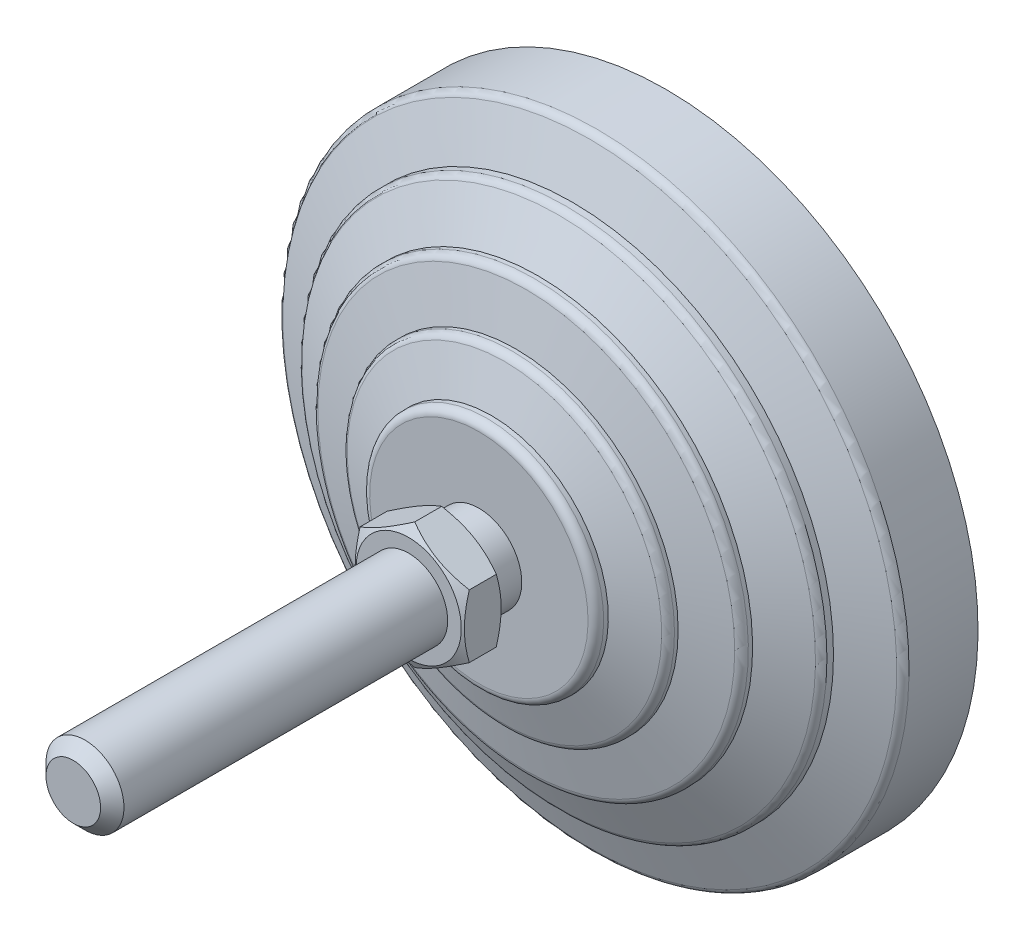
ISO-10303-21;
HEADER;
FILE_DESCRIPTION(('STEP AP214'),'2;1');
FILE_NAME('part.step','',(''),(''),'','','');
FILE_SCHEMA(('AUTOMOTIVE_DESIGN { 1 0 10303 214 1 1 1 1 }'));
ENDSEC;
DATA;
#1=APPLICATION_CONTEXT('core data for automotive mechanical design processes');
#2=APPLICATION_PROTOCOL_DEFINITION('international standard','automotive_design',2000,#1);
#3=PRODUCT_CONTEXT('',#1,'mechanical');
#4=PRODUCT('Part','Part','',(#3));
#5=PRODUCT_RELATED_PRODUCT_CATEGORY('part','',(#4));
#6=PRODUCT_DEFINITION_FORMATION('','',#4);
#7=PRODUCT_DEFINITION_CONTEXT('part definition',#1,'design');
#8=PRODUCT_DEFINITION('design','',#6,#7);
#9=PRODUCT_DEFINITION_SHAPE('','',#8);
#10=(LENGTH_UNIT() NAMED_UNIT(*) SI_UNIT(.MILLI.,.METRE.));
#11=(NAMED_UNIT(*) PLANE_ANGLE_UNIT() SI_UNIT($,.RADIAN.));
#12=(NAMED_UNIT(*) SI_UNIT($,.STERADIAN.) SOLID_ANGLE_UNIT());
#13=UNCERTAINTY_MEASURE_WITH_UNIT(LENGTH_MEASURE(1.E-05),#10,'distance_accuracy_value','');
#14=(GEOMETRIC_REPRESENTATION_CONTEXT(3) GLOBAL_UNCERTAINTY_ASSIGNED_CONTEXT((#13)) GLOBAL_UNIT_ASSIGNED_CONTEXT((#10,
#11,#12)) REPRESENTATION_CONTEXT('',''));
#15=CARTESIAN_POINT('',(0.,0.,0.));
#16=DIRECTION('',(0.,0.,1.));
#17=DIRECTION('',(1.,0.,0.));
#18=AXIS2_PLACEMENT_3D('',#15,#16,#17);
#19=CARTESIAN_POINT('',(-5.50000000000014,0.,31.));
#20=DIRECTION('',(0.,0.,1.));
#21=DIRECTION('',(0.,-1.,0.));
#22=AXIS2_PLACEMENT_3D('',#19,#20,#21);
#23=PLANE('',#22);
#24=CARTESIAN_POINT('',(0.,0.,31.));
#25=DIRECTION('',(0.,0.,-1.));
#26=DIRECTION('',(-1.,0.,0.));
#27=AXIS2_PLACEMENT_3D('',#24,#25,#26);
#28=CIRCLE('',#27,6.75);
#29=CARTESIAN_POINT('',(-6.75,0.,31.));
#30=VERTEX_POINT('',#29);
#31=EDGE_CURVE('E570',#30,#30,#28,.T.);
#32=ORIENTED_EDGE('',*,*,#31,.T.);
#33=EDGE_LOOP('',(#32));
#34=FACE_BOUND('',#33,.T.);
#35=CARTESIAN_POINT('',(0.,0.,31.));
#36=DIRECTION('',(0.,0.,-1.));
#37=DIRECTION('',(0.,1.,0.));
#38=AXIS2_PLACEMENT_3D('',#35,#36,#37);
#39=CIRCLE('',#38,5.50000000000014);
#40=CARTESIAN_POINT('',(0.,5.50000000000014,31.));
#41=VERTEX_POINT('',#40);
#42=EDGE_CURVE('E150',#41,#41,#39,.T.);
#43=ORIENTED_EDGE('',*,*,#42,.F.);
#44=EDGE_LOOP('',(#43));
#45=FACE_BOUND('',#44,.T.);
#46=ADVANCED_FACE('F14',(#34,#45),#23,.F.);
#47=CARTESIAN_POINT('',(0.,0.,0.));
#48=DIRECTION('',(0.,0.,-1.));
#49=DIRECTION('',(0.,1.,0.));
#50=AXIS2_PLACEMENT_3D('',#47,#48,#49);
#51=CYLINDRICAL_SURFACE('',#50,5.50000000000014);
#52=CARTESIAN_POINT('',(0.,0.,27.));
#53=DIRECTION('',(0.,0.,-1.));
#54=DIRECTION('',(0.,1.,0.));
#55=AXIS2_PLACEMENT_3D('',#52,#53,#54);
#56=CIRCLE('',#55,5.50000000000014);
#57=CARTESIAN_POINT('',(0.,5.50000000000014,27.));
#58=VERTEX_POINT('',#57);
#59=EDGE_CURVE('E147',#58,#58,#56,.T.);
#60=ORIENTED_EDGE('',*,*,#59,.F.);
#61=EDGE_LOOP('',(#60));
#62=FACE_BOUND('',#61,.T.);
#63=ORIENTED_EDGE('',*,*,#42,.T.);
#64=EDGE_LOOP('',(#63));
#65=FACE_BOUND('',#64,.T.);
#66=ADVANCED_FACE('F174',(#62,#65),#51,.T.);
#67=CARTESIAN_POINT('',(-5.50000000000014,0.,27.));
#68=DIRECTION('',(0.,0.,-1.));
#69=DIRECTION('',(0.,1.,0.));
#70=AXIS2_PLACEMENT_3D('',#67,#68,#69);
#71=PLANE('',#70);
#72=CARTESIAN_POINT('',(0.,0.,27.));
#73=DIRECTION('',(0.,0.,-1.));
#74=DIRECTION('',(0.,1.,0.));
#75=AXIS2_PLACEMENT_3D('',#72,#73,#74);
#76=CIRCLE('',#75,14.);
#77=CARTESIAN_POINT('',(0.,14.,27.));
#78=VERTEX_POINT('',#77);
#79=EDGE_CURVE('E144',#78,#78,#76,.T.);
#80=ORIENTED_EDGE('',*,*,#79,.F.);
#81=EDGE_LOOP('',(#80));
#82=FACE_BOUND('',#81,.T.);
#83=ORIENTED_EDGE('',*,*,#59,.T.);
#84=EDGE_LOOP('',(#83));
#85=FACE_BOUND('',#84,.T.);
#86=ADVANCED_FACE('F181',(#82,#85),#71,.F.);
#87=CARTESIAN_POINT('',(0.,0.,26.));
#88=DIRECTION('',(0.,0.,-1.));
#89=DIRECTION('',(0.,1.,0.));
#90=AXIS2_PLACEMENT_3D('',#87,#88,#89);
#91=TOROIDAL_SURFACE('',#90,14.,1.);
#92=CARTESIAN_POINT('',(0.,0.,26.));
#93=DIRECTION('',(0.,0.,-1.));
#94=DIRECTION('',(0.,1.,0.));
#95=AXIS2_PLACEMENT_3D('',#92,#93,#94);
#96=CIRCLE('',#95,15.);
#97=CARTESIAN_POINT('',(0.,15.,26.));
#98=VERTEX_POINT('',#97);
#99=EDGE_CURVE('E141',#98,#98,#96,.T.);
#100=ORIENTED_EDGE('',*,*,#99,.F.);
#101=EDGE_LOOP('',(#100));
#102=FACE_BOUND('',#101,.T.);
#103=ORIENTED_EDGE('',*,*,#79,.T.);
#104=EDGE_LOOP('',(#103));
#105=FACE_BOUND('',#104,.T.);
#106=ADVANCED_FACE('F433',(#102,#105),#91,.T.);
#107=CARTESIAN_POINT('',(0.,0.,0.));
#108=DIRECTION('',(0.,0.,-1.));
#109=DIRECTION('',(0.,1.,0.));
#110=AXIS2_PLACEMENT_3D('',#107,#108,#109);
#111=CYLINDRICAL_SURFACE('',#110,15.);
#112=CARTESIAN_POINT('',(0.,0.,25.4025287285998));
#113=DIRECTION('',(0.,0.,-1.));
#114=DIRECTION('',(0.,1.,0.));
#115=AXIS2_PLACEMENT_3D('',#112,#113,#114);
#116=CIRCLE('',#115,15.);
#117=CARTESIAN_POINT('',(0.,15.,25.4025287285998));
#118=VERTEX_POINT('',#117);
#119=EDGE_CURVE('E138',#118,#118,#116,.T.);
#120=ORIENTED_EDGE('',*,*,#119,.F.);
#121=EDGE_LOOP('',(#120));
#122=FACE_BOUND('',#121,.T.);
#123=ORIENTED_EDGE('',*,*,#99,.T.);
#124=EDGE_LOOP('',(#123));
#125=FACE_BOUND('',#124,.T.);
#126=ADVANCED_FACE('F423',(#122,#125),#111,.T.);
#127=CARTESIAN_POINT('',(0.,0.,25.4025287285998));
#128=DIRECTION('',(0.,0.,-1.));
#129=DIRECTION('',(0.,1.,0.));
#130=AXIS2_PLACEMENT_3D('',#127,#128,#129);
#131=CONICAL_SURFACE('',#130,15.,1.25589726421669);
#132=CARTESIAN_POINT('',(0.,0.,23.7216684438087));
#133=DIRECTION('',(0.,0.,-1.));
#134=DIRECTION('',(0.,1.,0.));
#135=AXIS2_PLACEMENT_3D('',#132,#133,#134);
#136=CIRCLE('',#135,20.1601635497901);
#137=CARTESIAN_POINT('',(0.,20.1601635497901,23.7216684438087));
#138=VERTEX_POINT('',#137);
#139=EDGE_CURVE('E135',#138,#138,#136,.T.);
#140=ORIENTED_EDGE('',*,*,#139,.F.);
#141=EDGE_LOOP('',(#140));
#142=FACE_BOUND('',#141,.T.);
#143=ORIENTED_EDGE('',*,*,#119,.T.);
#144=EDGE_LOOP('',(#143));
#145=FACE_BOUND('',#144,.T.);
#146=ADVANCED_FACE('F413',(#142,#145),#131,.T.);
#147=CARTESIAN_POINT('',(0.,0.,22.7708407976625));
#148=DIRECTION('',(0.,0.,-1.));
#149=DIRECTION('',(0.,1.,0.));
#150=AXIS2_PLACEMENT_3D('',#147,#148,#149);
#151=TOROIDAL_SURFACE('',#150,19.8504430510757,1.);
#152=CARTESIAN_POINT('',(0.,0.,22.7708407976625));
#153=DIRECTION('',(0.,0.,-1.));
#154=DIRECTION('',(0.,1.,0.));
#155=AXIS2_PLACEMENT_3D('',#152,#153,#154);
#156=CIRCLE('',#155,20.8504430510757);
#157=CARTESIAN_POINT('',(0.,20.8504430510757,22.7708407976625));
#158=VERTEX_POINT('',#157);
#159=EDGE_CURVE('E132',#158,#158,#156,.T.);
#160=ORIENTED_EDGE('',*,*,#159,.F.);
#161=EDGE_LOOP('',(#160));
#162=FACE_BOUND('',#161,.T.);
#163=ORIENTED_EDGE('',*,*,#139,.T.);
#164=EDGE_LOOP('',(#163));
#165=FACE_BOUND('',#164,.T.);
#166=ADVANCED_FACE('F403',(#162,#165),#151,.T.);
#167=CARTESIAN_POINT('',(0.,0.,0.));
#168=DIRECTION('',(0.,0.,-1.));
#169=DIRECTION('',(0.,1.,0.));
#170=AXIS2_PLACEMENT_3D('',#167,#168,#169);
#171=CYLINDRICAL_SURFACE('',#170,20.8504430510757);
#172=CARTESIAN_POINT('',(0.,0.,22.2987385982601));
#173=DIRECTION('',(0.,0.,-1.));
#174=DIRECTION('',(0.,1.,0.));
#175=AXIS2_PLACEMENT_3D('',#172,#173,#174);
#176=CIRCLE('',#175,20.8504430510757);
#177=CARTESIAN_POINT('',(0.,20.8504430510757,22.2987385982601));
#178=VERTEX_POINT('',#177);
#179=EDGE_CURVE('E129',#178,#178,#176,.T.);
#180=ORIENTED_EDGE('',*,*,#179,.F.);
#181=EDGE_LOOP('',(#180));
#182=FACE_BOUND('',#181,.T.);
#183=ORIENTED_EDGE('',*,*,#159,.T.);
#184=EDGE_LOOP('',(#183));
#185=FACE_BOUND('',#184,.T.);
#186=ADVANCED_FACE('F393',(#182,#185),#171,.T.);
#187=CARTESIAN_POINT('',(0.,0.,22.2987385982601));
#188=DIRECTION('',(0.,0.,-1.));
#189=DIRECTION('',(0.,1.,0.));
#190=AXIS2_PLACEMENT_3D('',#187,#188,#189);
#191=CONICAL_SURFACE('',#190,20.8504430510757,1.34067144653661);
#192=CARTESIAN_POINT('',(0.,0.,20.9217501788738));
#193=DIRECTION('',(0.,0.,-1.));
#194=DIRECTION('',(0.,1.,0.));
#195=AXIS2_PLACEMENT_3D('',#192,#193,#194);
#196=CIRCLE('',#195,26.7280991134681);
#197=CARTESIAN_POINT('',(0.,26.7280991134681,20.9217501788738));
#198=VERTEX_POINT('',#197);
#199=EDGE_CURVE('E126',#198,#198,#196,.T.);
#200=ORIENTED_EDGE('',*,*,#199,.F.);
#201=EDGE_LOOP('',(#200));
#202=FACE_BOUND('',#201,.T.);
#203=ORIENTED_EDGE('',*,*,#179,.T.);
#204=EDGE_LOOP('',(#203));
#205=FACE_BOUND('',#204,.T.);
#206=ADVANCED_FACE('F383',(#202,#205),#191,.T.);
#207=CARTESIAN_POINT('',(0.,0.,19.9481122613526));
#208=DIRECTION('',(0.,0.,-1.));
#209=DIRECTION('',(0.,1.,0.));
#210=AXIS2_PLACEMENT_3D('',#207,#208,#209);
#211=TOROIDAL_SURFACE('',#210,26.5,1.);
#212=CARTESIAN_POINT('',(0.,0.,19.9481122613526));
#213=DIRECTION('',(0.,0.,-1.));
#214=DIRECTION('',(0.,1.,0.));
#215=AXIS2_PLACEMENT_3D('',#212,#213,#214);
#216=CIRCLE('',#215,27.5);
#217=CARTESIAN_POINT('',(0.,27.5,19.9481122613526));
#218=VERTEX_POINT('',#217);
#219=EDGE_CURVE('E123',#218,#218,#216,.T.);
#220=ORIENTED_EDGE('',*,*,#219,.F.);
#221=EDGE_LOOP('',(#220));
#222=FACE_BOUND('',#221,.T.);
#223=ORIENTED_EDGE('',*,*,#199,.T.);
#224=EDGE_LOOP('',(#223));
#225=FACE_BOUND('',#224,.T.);
#226=ADVANCED_FACE('F373',(#222,#225),#211,.T.);
#227=CARTESIAN_POINT('',(0.,0.,0.));
#228=DIRECTION('',(0.,0.,-1.));
#229=DIRECTION('',(0.,1.,0.));
#230=AXIS2_PLACEMENT_3D('',#227,#228,#229);
#231=CYLINDRICAL_SURFACE('',#230,27.5);
#232=CARTESIAN_POINT('',(0.,0.,19.4025287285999));
#233=DIRECTION('',(0.,0.,-1.));
#234=DIRECTION('',(0.,1.,0.));
#235=AXIS2_PLACEMENT_3D('',#232,#233,#234);
#236=CIRCLE('',#235,27.5);
#237=CARTESIAN_POINT('',(0.,27.5,19.4025287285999));
#238=VERTEX_POINT('',#237);
#239=EDGE_CURVE('E120',#238,#238,#236,.T.);
#240=ORIENTED_EDGE('',*,*,#239,.F.);
#241=EDGE_LOOP('',(#240));
#242=FACE_BOUND('',#241,.T.);
#243=ORIENTED_EDGE('',*,*,#219,.T.);
#244=EDGE_LOOP('',(#243));
#245=FACE_BOUND('',#244,.T.);
#246=ADVANCED_FACE('F363',(#242,#245),#231,.T.);
#247=CARTESIAN_POINT('',(0.,0.,19.4025287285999));
#248=DIRECTION('',(0.,0.,-1.));
#249=DIRECTION('',(0.,1.,0.));
#250=AXIS2_PLACEMENT_3D('',#247,#248,#249);
#251=CONICAL_SURFACE('',#250,27.5,1.12022914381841);
#252=CARTESIAN_POINT('',(0.,0.,16.7730910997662));
#253=DIRECTION('',(0.,0.,-1.));
#254=DIRECTION('',(0.,1.,0.));
#255=AXIS2_PLACEMENT_3D('',#252,#253,#254);
#256=CIRCLE('',#255,32.9354761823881);
#257=CARTESIAN_POINT('',(0.,32.9354761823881,16.7730910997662));
#258=VERTEX_POINT('',#257);
#259=EDGE_CURVE('E117',#258,#258,#256,.T.);
#260=ORIENTED_EDGE('',*,*,#259,.F.);
#261=EDGE_LOOP('',(#260));
#262=FACE_BOUND('',#261,.T.);
#263=ORIENTED_EDGE('',*,*,#239,.T.);
#264=EDGE_LOOP('',(#263));
#265=FACE_BOUND('',#264,.T.);
#266=ADVANCED_FACE('F353',(#262,#265),#251,.T.);
#267=CARTESIAN_POINT('',(0.,0.,15.8728908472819));
#268=DIRECTION('',(0.,0.,-1.));
#269=DIRECTION('',(0.,1.,0.));
#270=AXIS2_PLACEMENT_3D('',#267,#268,#269);
#271=TOROIDAL_SURFACE('',#270,32.5,1.);
#272=CARTESIAN_POINT('',(0.,0.,15.8728908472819));
#273=DIRECTION('',(0.,0.,-1.));
#274=DIRECTION('',(0.,1.,0.));
#275=AXIS2_PLACEMENT_3D('',#272,#273,#274);
#276=CIRCLE('',#275,33.5);
#277=CARTESIAN_POINT('',(0.,33.5,15.8728908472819));
#278=VERTEX_POINT('',#277);
#279=EDGE_CURVE('E114',#278,#278,#276,.T.);
#280=ORIENTED_EDGE('',*,*,#279,.F.);
#281=EDGE_LOOP('',(#280));
#282=FACE_BOUND('',#281,.T.);
#283=ORIENTED_EDGE('',*,*,#259,.T.);
#284=EDGE_LOOP('',(#283));
#285=FACE_BOUND('',#284,.T.);
#286=ADVANCED_FACE('F343',(#282,#285),#271,.T.);
#287=CARTESIAN_POINT('',(0.,0.,0.));
#288=DIRECTION('',(0.,0.,-1.));
#289=DIRECTION('',(0.,1.,0.));
#290=AXIS2_PLACEMENT_3D('',#287,#288,#289);
#291=CYLINDRICAL_SURFACE('',#290,33.5);
#292=CARTESIAN_POINT('',(0.,0.,15.0315037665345));
#293=DIRECTION('',(0.,0.,-1.));
#294=DIRECTION('',(0.,1.,0.));
#295=AXIS2_PLACEMENT_3D('',#292,#293,#294);
#296=CIRCLE('',#295,33.5);
#297=CARTESIAN_POINT('',(0.,33.5,15.0315037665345));
#298=VERTEX_POINT('',#297);
#299=EDGE_CURVE('E111',#298,#298,#296,.T.);
#300=ORIENTED_EDGE('',*,*,#299,.F.);
#301=EDGE_LOOP('',(#300));
#302=FACE_BOUND('',#301,.T.);
#303=ORIENTED_EDGE('',*,*,#279,.T.);
#304=EDGE_LOOP('',(#303));
#305=FACE_BOUND('',#304,.T.);
#306=ADVANCED_FACE('F333',(#302,#305),#291,.T.);
#307=CARTESIAN_POINT('',(0.,0.,15.0315037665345));
#308=DIRECTION('',(0.,0.,-1.));
#309=DIRECTION('',(0.,1.,0.));
#310=AXIS2_PLACEMENT_3D('',#307,#308,#309);
#311=CONICAL_SURFACE('',#310,33.5,1.20362249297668);
#312=CARTESIAN_POINT('',(0.,0.,12.7780502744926));
#313=DIRECTION('',(0.,0.,-1.));
#314=DIRECTION('',(0.,1.,0.));
#315=AXIS2_PLACEMENT_3D('',#312,#313,#314);
#316=CIRCLE('',#315,39.358979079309);
#317=CARTESIAN_POINT('',(0.,39.358979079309,12.7780502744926));
#318=VERTEX_POINT('',#317);
#319=EDGE_CURVE('E108',#318,#318,#316,.T.);
#320=ORIENTED_EDGE('',*,*,#319,.F.);
#321=EDGE_LOOP('',(#320));
#322=FACE_BOUND('',#321,.T.);
#323=ORIENTED_EDGE('',*,*,#299,.T.);
#324=EDGE_LOOP('',(#323));
#325=FACE_BOUND('',#324,.T.);
#326=ADVANCED_FACE('F323',(#322,#325),#311,.T.);
#327=CARTESIAN_POINT('',(0.,0.,11.8447046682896));
#328=DIRECTION('',(0.,0.,-1.));
#329=DIRECTION('',(0.,1.,0.));
#330=AXIS2_PLACEMENT_3D('',#327,#328,#329);
#331=TOROIDAL_SURFACE('',#330,39.,1.);
#332=CARTESIAN_POINT('',(0.,0.,11.8447046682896));
#333=DIRECTION('',(0.,0.,-1.));
#334=DIRECTION('',(0.,1.,0.));
#335=AXIS2_PLACEMENT_3D('',#332,#333,#334);
#336=CIRCLE('',#335,40.);
#337=CARTESIAN_POINT('',(0.,40.,11.8447046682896));
#338=VERTEX_POINT('',#337);
#339=EDGE_CURVE('E105',#338,#338,#336,.T.);
#340=ORIENTED_EDGE('',*,*,#339,.F.);
#341=EDGE_LOOP('',(#340));
#342=FACE_BOUND('',#341,.T.);
#343=ORIENTED_EDGE('',*,*,#319,.T.);
#344=EDGE_LOOP('',(#343));
#345=FACE_BOUND('',#344,.T.);
#346=ADVANCED_FACE('F313',(#342,#345),#331,.T.);
#347=CARTESIAN_POINT('',(0.,0.,0.));
#348=DIRECTION('',(0.,0.,-1.));
#349=DIRECTION('',(0.,1.,0.));
#350=AXIS2_PLACEMENT_3D('',#347,#348,#349);
#351=CYLINDRICAL_SURFACE('',#350,40.);
#352=CARTESIAN_POINT('',(0.,0.,2.99999999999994));
#353=DIRECTION('',(0.,0.,-1.));
#354=DIRECTION('',(0.,1.,0.));
#355=AXIS2_PLACEMENT_3D('',#352,#353,#354);
#356=CIRCLE('',#355,40.);
#357=CARTESIAN_POINT('',(0.,40.,2.99999999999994));
#358=VERTEX_POINT('',#357);
#359=EDGE_CURVE('E102',#358,#358,#356,.T.);
#360=ORIENTED_EDGE('',*,*,#359,.F.);
#361=EDGE_LOOP('',(#360));
#362=FACE_BOUND('',#361,.T.);
#363=ORIENTED_EDGE('',*,*,#339,.T.);
#364=EDGE_LOOP('',(#363));
#365=FACE_BOUND('',#364,.T.);
#366=ADVANCED_FACE('F303',(#362,#365),#351,.T.);
#367=CARTESIAN_POINT('',(-33.5,0.,2.99999999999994));
#368=DIRECTION('',(0.,0.,1.));
#369=DIRECTION('',(0.,-1.,0.));
#370=AXIS2_PLACEMENT_3D('',#367,#368,#369);
#371=PLANE('',#370);
#372=CARTESIAN_POINT('',(0.,0.,2.99999999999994));
#373=DIRECTION('',(0.,0.,-1.));
#374=DIRECTION('',(0.,1.,0.));
#375=AXIS2_PLACEMENT_3D('',#372,#373,#374);
#376=CIRCLE('',#375,33.5);
#377=CARTESIAN_POINT('',(0.,33.5,2.99999999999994));
#378=VERTEX_POINT('',#377);
#379=EDGE_CURVE('E99',#378,#378,#376,.T.);
#380=ORIENTED_EDGE('',*,*,#379,.F.);
#381=EDGE_LOOP('',(#380));
#382=FACE_BOUND('',#381,.T.);
#383=ORIENTED_EDGE('',*,*,#359,.T.);
#384=EDGE_LOOP('',(#383));
#385=FACE_BOUND('',#384,.T.);
#386=ADVANCED_FACE('F293',(#382,#385),#371,.F.);
#387=CARTESIAN_POINT('',(0.,0.,0.));
#388=DIRECTION('',(0.,0.,-1.));
#389=DIRECTION('',(0.,1.,0.));
#390=AXIS2_PLACEMENT_3D('',#387,#388,#389);
#391=CYLINDRICAL_SURFACE('',#390,33.5);
#392=CARTESIAN_POINT('',(0.,0.,0.));
#393=DIRECTION('',(0.,0.,-1.));
#394=DIRECTION('',(0.,1.,0.));
#395=AXIS2_PLACEMENT_3D('',#392,#393,#394);
#396=CIRCLE('',#395,33.5);
#397=CARTESIAN_POINT('',(0.,33.5,0.));
#398=VERTEX_POINT('',#397);
#399=EDGE_CURVE('E96',#398,#398,#396,.T.);
#400=ORIENTED_EDGE('',*,*,#399,.F.);
#401=EDGE_LOOP('',(#400));
#402=FACE_BOUND('',#401,.T.);
#403=ORIENTED_EDGE('',*,*,#379,.T.);
#404=EDGE_LOOP('',(#403));
#405=FACE_BOUND('',#404,.T.);
#406=ADVANCED_FACE('F282',(#402,#405),#391,.T.);
#407=CARTESIAN_POINT('',(0.,0.,0.));
#408=DIRECTION('',(0.,0.,1.));
#409=DIRECTION('',(0.,-1.,0.));
#410=AXIS2_PLACEMENT_3D('',#407,#408,#409);
#411=PLANE('',#410);
#412=ORIENTED_EDGE('',*,*,#399,.T.);
#413=EDGE_LOOP('',(#412));
#414=FACE_BOUND('',#413,.T.);
#415=ADVANCED_FACE('F172',(#414),#411,.F.);
#416=CARTESIAN_POINT('',(0.,0.,32.6165403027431));
#417=DIRECTION('',(0.,0.,1.));
#418=DIRECTION('',(1.,0.,0.));
#419=AXIS2_PLACEMENT_3D('',#416,#417,#418);
#420=CONICAL_SURFACE('',#419,9.54992993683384,1.0471975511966);
#421=CARTESIAN_POINT('',(0.255366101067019,-8.23033945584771,31.8569611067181));
#422=CARTESIAN_POINT('',(-0.0712378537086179,-8.0417745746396,31.7422841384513));
#423=CARTESIAN_POINT('',(-0.400896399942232,-7.85144612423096,31.637333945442));
#424=CARTESIAN_POINT('',(-1.06658957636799,-7.46710798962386,31.4530986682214));
#425=CARTESIAN_POINT('',(-1.4026410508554,-7.27308858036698,31.3738956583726));
#426=CARTESIAN_POINT('',(-1.90529858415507,-6.98287911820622,31.2805043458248));
#427=CARTESIAN_POINT('',(-2.07015828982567,-6.88769732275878,31.2538289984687));
#428=CARTESIAN_POINT('',(-2.40073982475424,-6.69683598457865,31.2088278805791));
#429=CARTESIAN_POINT('',(-2.56646166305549,-6.60115643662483,31.1905021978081));
#430=CARTESIAN_POINT('',(-2.89819776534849,-6.40962850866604,31.1627233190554));
#431=CARTESIAN_POINT('',(-3.0642111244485,-6.31378065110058,31.1532558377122));
#432=CARTESIAN_POINT('',(-3.39644095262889,-6.1219676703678,31.143412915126));
#433=CARTESIAN_POINT('',(-3.56265742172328,-6.02600254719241,31.1430374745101));
#434=CARTESIAN_POINT('',(-3.90535117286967,-5.82814821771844,31.1516542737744));
#435=CARTESIAN_POINT('',(-4.08181743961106,-5.72626537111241,31.1612361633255));
#436=CARTESIAN_POINT('',(-4.43412971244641,-5.52285778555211,31.1903751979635));
#437=CARTESIAN_POINT('',(-4.60997569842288,-5.42133305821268,31.2099326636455));
#438=CARTESIAN_POINT('',(-4.96101631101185,-5.21865966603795,31.2584721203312));
#439=CARTESIAN_POINT('',(-5.13620909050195,-5.11751206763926,31.2874717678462));
#440=CARTESIAN_POINT('',(-5.48536391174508,-4.91592743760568,31.3540908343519));
#441=CARTESIAN_POINT('',(-5.65932586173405,-4.8154904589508,31.3917108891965));
#442=CARTESIAN_POINT('',(-6.01138787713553,-4.61222735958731,31.4759960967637));
#443=CARTESIAN_POINT('',(-6.18944266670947,-4.5094273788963,31.5229117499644));
#444=CARTESIAN_POINT('',(-6.5440187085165,-4.30471280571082,31.6239651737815));
#445=CARTESIAN_POINT('',(-6.72053979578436,-4.20279830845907,31.6781037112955));
#446=CARTESIAN_POINT('',(-7.07131469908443,-4.00027832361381,31.7923985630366));
#447=CARTESIAN_POINT('',(-7.2455748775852,-3.89966916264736,31.8525290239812));
#448=CARTESIAN_POINT('',(-7.59257656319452,-3.69932764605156,31.9781317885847));
#449=CARTESIAN_POINT('',(-7.76531861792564,-3.59959497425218,32.0436020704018));
#450=CARTESIAN_POINT('',(-7.93737121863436,-3.50026035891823,32.1113346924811));
#451=B_SPLINE_CURVE_WITH_KNOTS('',3,(#421,#422,#423,#424,#425,#426,#427,#428,#429,#430,#431,
#432,#433,#434,#435,#436,#437,#438,#439,#440,#441,#442,#443,#444,#445,#446,#447,#448,#449,#450),
.UNSPECIFIED.,.F.,.F.,(4,2,2,2,2,2,2,2,2,2,2,2,2,2,4),(0.,1.1832835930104,2.37030297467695,
2.94680456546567,3.52331221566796,4.09888853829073,4.67446490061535,5.28618004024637,
5.8979148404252,6.51080019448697,7.12373077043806,7.75623637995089,8.38880919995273,
9.01876201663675,9.64847740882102),.UNSPECIFIED.);
#452=CARTESIAN_POINT('',(0.,-8.08290376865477,31.7695523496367));
#453=VERTEX_POINT('',#452);
#454=CARTESIAN_POINT('',(-7.,-4.04145188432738,31.7695523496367));
#455=VERTEX_POINT('',#454);
#456=EDGE_CURVE('E73',#453,#455,#451,.T.);
#457=ORIENTED_EDGE('',*,*,#456,.T.);
#458=CARTESIAN_POINT('',(-7.,-10.8162923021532,34.5413483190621));
#459=CARTESIAN_POINT('',(-7.,-10.5108844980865,34.3933575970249));
#460=CARTESIAN_POINT('',(-7.,-10.2047713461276,34.2467973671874));
#461=CARTESIAN_POINT('',(-7.,-9.59075907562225,33.9573432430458));
#462=CARTESIAN_POINT('',(-7.,-9.28285968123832,33.8144499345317));
#463=CARTESIAN_POINT('',(-7.,-8.66329422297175,33.5324076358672));
#464=CARTESIAN_POINT('',(-7.,-8.35161675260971,33.3932836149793));
#465=CARTESIAN_POINT('',(-7.,-7.72576898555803,33.1207821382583));
#466=CARTESIAN_POINT('',(-7.,-7.41159880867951,32.9874044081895));
#467=CARTESIAN_POINT('',(-7.,-6.77028098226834,32.723810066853));
#468=CARTESIAN_POINT('',(-7.,-6.44303698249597,32.5938265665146));
#469=CARTESIAN_POINT('',(-7.,-5.78470667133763,32.3437932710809));
#470=CARTESIAN_POINT('',(-7.,-5.45361993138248,32.2237445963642));
#471=CARTESIAN_POINT('',(-7.,-4.7877059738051,31.9967618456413));
#472=CARTESIAN_POINT('',(-7.,-4.45288802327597,31.8898008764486));
#473=CARTESIAN_POINT('',(-7.,-3.77846181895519,31.692450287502));
#474=CARTESIAN_POINT('',(-7.,-3.43885512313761,31.6020554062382));
#475=CARTESIAN_POINT('',(-7.,-2.75647790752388,31.4426854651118));
#476=CARTESIAN_POINT('',(-7.,-2.41373489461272,31.3735958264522));
#477=CARTESIAN_POINT('',(-7.,-1.89653113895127,31.2889514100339));
#478=CARTESIAN_POINT('',(-7.,-1.72360201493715,31.2639004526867));
#479=CARTESIAN_POINT('',(-7.,-1.37689773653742,31.2206207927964));
#480=CARTESIAN_POINT('',(-7.,-1.20312266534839,31.2023914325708));
#481=CARTESIAN_POINT('',(-7.,-0.857212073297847,31.1733447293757));
#482=CARTESIAN_POINT('',(-7.,-0.685084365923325,31.1624346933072));
#483=CARTESIAN_POINT('',(-7.,-0.340522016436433,31.1479005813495));
#484=CARTESIAN_POINT('',(-7.,-0.168087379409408,31.1442763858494));
#485=CARTESIAN_POINT('',(-7.,0.176781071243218,31.144400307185));
#486=CARTESIAN_POINT('',(-7.,0.349214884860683,31.1481484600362));
#487=CARTESIAN_POINT('',(-7.,0.693772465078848,31.1629261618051));
#488=CARTESIAN_POINT('',(-7.,0.865896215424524,31.1739560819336));
#489=CARTESIAN_POINT('',(-7.,1.28076758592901,31.2090853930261));
#490=CARTESIAN_POINT('',(-7.,1.52322315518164,31.2367066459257));
#491=CARTESIAN_POINT('',(-7.,2.00629730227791,31.3048813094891));
#492=CARTESIAN_POINT('',(-7.,2.24691562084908,31.3454365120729));
#493=CARTESIAN_POINT('',(-7.,2.96576061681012,31.4843493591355));
#494=CARTESIAN_POINT('',(-7.,3.44070139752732,31.5999278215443));
#495=CARTESIAN_POINT('',(-7.,4.15081410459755,31.7998800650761));
#496=CARTESIAN_POINT('',(-7.,4.38968113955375,31.8718816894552));
#497=CARTESIAN_POINT('',(-7.,4.86509434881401,32.0232458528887));
#498=CARTESIAN_POINT('',(-7.,5.10164050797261,32.1026084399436));
#499=CARTESIAN_POINT('',(-7.,5.57248866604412,32.2674309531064));
#500=CARTESIAN_POINT('',(-7.,5.80679140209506,32.3528887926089));
#501=CARTESIAN_POINT('',(-7.,6.27346351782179,32.5289080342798));
#502=CARTESIAN_POINT('',(-7.,6.50583291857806,32.6194693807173));
#503=CARTESIAN_POINT('',(-7.,7.04779474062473,32.8364509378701));
#504=CARTESIAN_POINT('',(-7.,7.35670559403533,32.9645702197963));
#505=CARTESIAN_POINT('',(-7.,7.97195620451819,33.2268574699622));
#506=CARTESIAN_POINT('',(-7.,8.27829581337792,33.3610257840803));
#507=CARTESIAN_POINT('',(-7.,8.88886846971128,33.6342142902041));
#508=CARTESIAN_POINT('',(-7.,9.19310110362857,33.7732354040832));
#509=CARTESIAN_POINT('',(-7.,9.79975913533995,34.0551732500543));
#510=CARTESIAN_POINT('',(-7.,10.1021844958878,34.1980900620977));
#511=CARTESIAN_POINT('',(-7.,10.7058230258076,34.4872436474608));
#512=CARTESIAN_POINT('',(-7.,11.0070346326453,34.6334836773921));
#513=CARTESIAN_POINT('',(-7.,11.6081723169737,34.9285848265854));
#514=CARTESIAN_POINT('',(-7.,11.9080983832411,35.0774459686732));
#515=CARTESIAN_POINT('',(-7.,12.8061756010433,35.5272353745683));
#516=CARTESIAN_POINT('',(-7.,13.402702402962,35.8314066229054));
#517=CARTESIAN_POINT('',(-7.,14.5437583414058,36.420639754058));
#518=CARTESIAN_POINT('',(-7.,15.0885367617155,36.7052210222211));
#519=CARTESIAN_POINT('',(-7.,16.176064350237,37.2782758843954));
#520=CARTESIAN_POINT('',(-7.,16.7188134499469,37.5667496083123));
#521=CARTESIAN_POINT('',(-7.,17.801421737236,38.1459713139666));
#522=CARTESIAN_POINT('',(-7.,18.3412847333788,38.4367121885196));
#523=CARTESIAN_POINT('',(-7.,19.4197095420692,39.0205300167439));
#524=CARTESIAN_POINT('',(-7.,19.9582714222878,39.3136068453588));
#525=CARTESIAN_POINT('',(-7.,20.4963525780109,39.6075577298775));
#526=B_SPLINE_CURVE_WITH_KNOTS('',3,(#458,#459,#460,#461,#462,#463,#464,#465,#466,#467,#468,
#469,#470,#471,#472,#473,#474,#475,#476,#477,#478,#479,#480,#481,#482,#483,#484,#485,#486,#487,
#488,#489,#490,#491,#492,#493,#494,#495,#496,#497,#498,#499,#500,#501,#502,#503,#504,#505,#506,
#507,#508,#509,#510,#511,#512,#513,#514,#515,#516,#517,#518,#519,#520,#521,#522,#523,#524,#525),
.UNSPECIFIED.,.F.,.F.,(4,2,2,2,2,2,2,2,2,2,2,2,2,2,2,2,2,2,2,2,2,2,2,2,2,2,2,2,2,2,2,2,2,4),(0.,
1.0181366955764,2.03643503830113,3.06034416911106,4.08420438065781,5.14042157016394,
6.19675771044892,7.25088543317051,8.30467777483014,9.35269983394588,9.87678896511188,
10.4008275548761,10.9180976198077,11.4353591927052,11.9526232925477,12.4699137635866,
13.2015710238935,13.9333296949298,15.3976749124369,16.1460625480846,16.8944550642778,
17.6425925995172,18.3907219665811,19.3939125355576,20.3971605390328,21.4006001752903,
22.4040604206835,23.4085504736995,24.4130492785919,26.4217916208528,28.2656647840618,
30.1095996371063,31.9491154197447,33.7885333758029),.UNSPECIFIED.);
#527=CARTESIAN_POINT('',(-7.,4.04145188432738,31.7695523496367));
#528=VERTEX_POINT('',#527);
#529=EDGE_CURVE('E81',#455,#528,#526,.T.);
#530=ORIENTED_EDGE('',*,*,#529,.T.);
#531=CARTESIAN_POINT('',(-12.7094469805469,0.745101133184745,34.453287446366));
#532=CARTESIAN_POINT('',(-12.4402108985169,0.900544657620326,34.3034090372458));
#533=CARTESIAN_POINT('',(-12.1703215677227,1.05636533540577,34.1550653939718));
#534=CARTESIAN_POINT('',(-11.6288750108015,1.36896965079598,33.8623436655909));
#535=CARTESIAN_POINT('',(-11.3573174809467,1.52575346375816,33.7179663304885));
#536=CARTESIAN_POINT('',(-10.810552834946,1.84142817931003,33.4332339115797));
#537=CARTESIAN_POINT('',(-10.5353335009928,2.00032613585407,33.2929099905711));
#538=CARTESIAN_POINT('',(-9.9825566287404,2.3194720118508,33.0185690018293));
#539=CARTESIAN_POINT('',(-9.70499922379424,2.47971985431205,32.8845515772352));
#540=CARTESIAN_POINT('',(-9.14443998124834,2.80335888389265,32.6233180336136));
#541=CARTESIAN_POINT('',(-8.86141149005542,2.96676545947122,32.4961777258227));
#542=CARTESIAN_POINT('',(-8.29191239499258,3.295565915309,32.2524160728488));
#543=CARTESIAN_POINT('',(-8.00544138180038,3.46096003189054,32.1357959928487));
#544=CARTESIAN_POINT('',(-7.42926027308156,3.79361835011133,31.9164455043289));
#545=CARTESIAN_POINT('',(-7.13955966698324,3.96087707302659,31.8136822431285));
#546=CARTESIAN_POINT('',(-6.55599305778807,4.2977994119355,31.625613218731));
#547=CARTESIAN_POINT('',(-6.26212854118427,4.46746216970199,31.5403013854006));
#548=CARTESIAN_POINT('',(-5.6751883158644,4.80633226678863,31.3928743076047));
#549=CARTESIAN_POINT('',(-5.3821843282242,4.97549819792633,31.330388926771));
#550=CARTESIAN_POINT('',(-4.94026529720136,5.23064026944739,31.2557426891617));
#551=CARTESIAN_POINT('',(-4.79253729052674,5.31593107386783,31.2340393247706));
#552=CARTESIAN_POINT('',(-4.49645603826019,5.48687366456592,31.1974232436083));
#553=CARTESIAN_POINT('',(-4.34810285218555,5.57252541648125,31.1825098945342));
#554=CARTESIAN_POINT('',(-4.05182394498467,5.74358212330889,31.1598672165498));
#555=CARTESIAN_POINT('',(-3.90390052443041,5.82898574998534,31.1520978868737));
#556=CARTESIAN_POINT('',(-3.60790236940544,5.99988036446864,31.1437755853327));
#557=CARTESIAN_POINT('',(-3.45982763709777,6.08537135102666,31.1432225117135));
#558=CARTESIAN_POINT('',(-3.16382766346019,6.25626701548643,31.1493456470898));
#559=CARTESIAN_POINT('',(-3.01590239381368,6.34167170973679,31.1560200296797));
#560=CARTESIAN_POINT('',(-2.72041603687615,6.51227083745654,31.1764396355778));
#561=CARTESIAN_POINT('',(-2.57285497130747,6.59746525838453,31.1901852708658));
#562=CARTESIAN_POINT('',(-2.20906291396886,6.80750070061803,31.2325135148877));
#563=CARTESIAN_POINT('',(-1.99316940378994,6.93214687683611,31.2650335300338));
#564=CARTESIAN_POINT('',(-1.56320340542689,7.1803878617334,31.3433450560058));
#565=CARTESIAN_POINT('',(-1.3491312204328,7.30398249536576,31.3891387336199));
#566=CARTESIAN_POINT('',(-0.709208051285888,7.6734423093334,31.5441154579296));
#567=CARTESIAN_POINT('',(-0.28650291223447,7.91749123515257,31.670782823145));
#568=CARTESIAN_POINT('',(0.345464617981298,8.28235785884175,31.8873052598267));
#569=CARTESIAN_POINT('',(0.558065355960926,8.4051029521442,31.9648912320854));
#570=CARTESIAN_POINT('',(0.981213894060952,8.64940787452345,32.127330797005));
#571=CARTESIAN_POINT('',(1.19176151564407,8.7709676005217,32.2121850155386));
#572=CARTESIAN_POINT('',(1.60974790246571,9.01229215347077,32.3873790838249));
#573=CARTESIAN_POINT('',(1.81719758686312,9.13206328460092,32.4776845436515));
#574=CARTESIAN_POINT('',(2.23036232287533,9.37060405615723,32.6632204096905));
#575=CARTESIAN_POINT('',(2.43607792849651,9.48937401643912,32.7584491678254));
#576=CARTESIAN_POINT('',(2.64106830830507,9.60772526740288,32.8556712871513));
#577=B_SPLINE_CURVE_WITH_KNOTS('',3,(#531,#532,#533,#534,#535,#536,#537,#538,#539,#540,#541,
#542,#543,#544,#545,#546,#547,#548,#549,#550,#551,#552,#553,#554,#555,#556,#557,#558,#559,#560,
#561,#562,#563,#564,#565,#566,#567,#568,#569,#570,#571,#572,#573,#574,#575,#576),.UNSPECIFIED.,
.F.,.F.,(4,2,2,2,2,2,2,2,2,2,2,2,2,2,2,2,2,2,2,2,2,2,4),(0.,1.03540333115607,2.07100112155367,
3.11313953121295,4.15521889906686,5.20709797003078,6.2591033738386,7.30856903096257,
8.3576690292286,9.38891109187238,9.90466711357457,10.420375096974,10.9331776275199,
11.4459729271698,11.9586386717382,12.471334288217,13.2251146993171,13.9790182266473,
15.4897840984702,16.2621068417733,17.0344961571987,17.8024392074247,18.570126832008),.UNSPECIFIED.);
#578=CARTESIAN_POINT('',(0.,8.08290376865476,31.7695523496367));
#579=VERTEX_POINT('',#578);
#580=EDGE_CURVE('E525',#528,#579,#577,.T.);
#581=ORIENTED_EDGE('',*,*,#580,.T.);
#582=CARTESIAN_POINT('',(-0.944645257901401,8.62829496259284,32.1142005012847));
#583=CARTESIAN_POINT('',(-0.772488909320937,8.5289004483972,32.046354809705));
#584=CARTESIAN_POINT('',(-0.599642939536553,8.42910778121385,31.9807696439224));
#585=CARTESIAN_POINT('',(-0.252432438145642,8.22864570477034,31.85493393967));
#586=CARTESIAN_POINT('',(-0.0780673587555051,8.12797597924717,31.7946854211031));
#587=CARTESIAN_POINT('',(0.272921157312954,7.92533266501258,31.6801507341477));
#588=CARTESIAN_POINT('',(0.449550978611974,7.82335539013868,31.6258904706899));
#589=CARTESIAN_POINT('',(0.804346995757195,7.61851381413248,31.5245922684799));
#590=CARTESIAN_POINT('',(0.982513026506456,7.51564960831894,31.4775535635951));
#591=CARTESIAN_POINT('',(1.33479389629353,7.31226015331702,31.3930275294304));
#592=CARTESIAN_POINT('',(1.50886332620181,7.21176112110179,31.3552895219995));
#593=CARTESIAN_POINT('',(1.8582370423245,7.01005011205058,31.2884373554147));
#594=CARTESIAN_POINT('',(2.03354123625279,6.90883818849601,31.2593225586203));
#595=CARTESIAN_POINT('',(2.38480853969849,6.70603391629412,31.2105591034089));
#596=CARTESIAN_POINT('',(2.56076979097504,6.60444264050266,31.1908927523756));
#597=CARTESIAN_POINT('',(2.91331720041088,6.40089929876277,31.1615455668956));
#598=CARTESIAN_POINT('',(3.08990333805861,6.2989472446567,31.1518644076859));
#599=CARTESIAN_POINT('',(3.43262955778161,6.10107416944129,31.1430728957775));
#600=CARTESIAN_POINT('',(3.59875817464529,6.00515976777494,31.1433609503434));
#601=CARTESIAN_POINT('',(3.93081613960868,5.81344601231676,31.1530208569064));
#602=CARTESIAN_POINT('',(4.09674548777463,5.71764665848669,31.1623927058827));
#603=CARTESIAN_POINT('',(4.42831689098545,5.52621381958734,31.1899748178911));
#604=CARTESIAN_POINT('',(4.59395804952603,5.43058085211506,31.2081993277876));
#605=CARTESIAN_POINT('',(4.92438199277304,5.2398104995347,31.252995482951));
#606=CARTESIAN_POINT('',(5.08916478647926,5.14467310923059,31.2795670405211));
#607=CARTESIAN_POINT('',(5.59158338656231,4.85460159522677,31.3726394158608));
#608=CARTESIAN_POINT('',(5.9274781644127,4.66067265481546,31.4516266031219));
#609=CARTESIAN_POINT('',(6.59286995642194,4.27650852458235,31.6354420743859));
#610=CARTESIAN_POINT('',(6.92238372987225,4.08626365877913,31.7401885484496));
#611=CARTESIAN_POINT('',(7.24884364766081,3.89778193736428,31.8546726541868));
#612=B_SPLINE_CURVE_WITH_KNOTS('',3,(#582,#583,#584,#585,#586,#587,#588,#589,#590,#591,#592,
#593,#594,#595,#596,#597,#598,#599,#600,#601,#602,#603,#604,#605,#606,#607,#608,#609,#610,#611),
.UNSPECIFIED.,.F.,.F.,(4,2,2,2,2,2,2,2,2,2,2,2,2,2,4),(0.,0.630165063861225,1.26056763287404,
1.89359842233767,2.52656200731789,3.13992377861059,3.75324018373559,4.36540360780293,
4.97754712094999,5.55281908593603,6.12809085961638,6.70429151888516,7.28048612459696,
8.46684332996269,9.64948032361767),.UNSPECIFIED.);
#613=CARTESIAN_POINT('',(7.,4.04145188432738,31.7695523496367));
#614=VERTEX_POINT('',#613);
#615=EDGE_CURVE('E520',#579,#614,#612,.T.);
#616=ORIENTED_EDGE('',*,*,#615,.T.);
#617=CARTESIAN_POINT('',(7.,-10.8162923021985,34.5413483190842));
#618=CARTESIAN_POINT('',(7.,-10.5108844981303,34.393357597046));
#619=CARTESIAN_POINT('',(7.,-10.2047713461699,34.2467973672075));
#620=CARTESIAN_POINT('',(7.,-9.5907590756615,33.9573432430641));
#621=CARTESIAN_POINT('',(7.,-9.28285968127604,33.8144499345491));
#622=CARTESIAN_POINT('',(7.,-8.66329422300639,33.5324076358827));
#623=CARTESIAN_POINT('',(7.,-8.35161675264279,33.3932836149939));
#624=CARTESIAN_POINT('',(7.,-7.72576898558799,33.1207821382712));
#625=CARTESIAN_POINT('',(7.,-7.41159880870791,32.9874044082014));
#626=CARTESIAN_POINT('',(7.,-6.77028098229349,32.723810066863));
#627=CARTESIAN_POINT('',(7.,-6.44303698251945,32.5938265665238));
#628=CARTESIAN_POINT('',(7.,-5.78470667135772,32.3437932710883));
#629=CARTESIAN_POINT('',(7.,-5.45361993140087,32.2237445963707));
#630=CARTESIAN_POINT('',(7.,-4.78770597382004,31.9967618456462));
#631=CARTESIAN_POINT('',(7.,-4.45288802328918,31.8898008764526));
#632=CARTESIAN_POINT('',(7.,-3.77846181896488,31.6924502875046));
#633=CARTESIAN_POINT('',(7.,-3.43885512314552,31.6020554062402));
#634=CARTESIAN_POINT('',(7.,-2.75647790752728,31.4426854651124));
#635=CARTESIAN_POINT('',(7.,-2.41373489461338,31.3735958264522));
#636=CARTESIAN_POINT('',(7.,-1.89653113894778,31.2889514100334));
#637=CARTESIAN_POINT('',(7.,-1.72360201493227,31.263900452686));
#638=CARTESIAN_POINT('',(7.,-1.37689773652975,31.2206207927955));
#639=CARTESIAN_POINT('',(7.,-1.20312266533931,31.2023914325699));
#640=CARTESIAN_POINT('',(7.,-0.857212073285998,31.1733447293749));
#641=CARTESIAN_POINT('',(7.,-0.685084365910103,31.1624346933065));
#642=CARTESIAN_POINT('',(7.,-0.340522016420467,31.147900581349));
#643=CARTESIAN_POINT('',(7.,-0.168087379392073,31.1442763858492));
#644=CARTESIAN_POINT('',(7.,0.176781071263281,31.1444003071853));
#645=CARTESIAN_POINT('',(7.,0.349214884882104,31.1481484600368));
#646=CARTESIAN_POINT('',(7.,0.693772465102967,31.1629261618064));
#647=CARTESIAN_POINT('',(7.,0.865896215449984,31.1739560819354));
#648=CARTESIAN_POINT('',(7.,1.28076758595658,31.209085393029));
#649=CARTESIAN_POINT('',(7.,1.52322315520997,31.2367066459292));
#650=CARTESIAN_POINT('',(7.,2.00629730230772,31.3048813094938));
#651=CARTESIAN_POINT('',(7.,2.24691562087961,31.3454365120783));
#652=CARTESIAN_POINT('',(7.,2.96576061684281,31.4843493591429));
#653=CARTESIAN_POINT('',(7.,3.44070139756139,31.599927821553));
#654=CARTESIAN_POINT('',(7.,4.15081410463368,31.7998800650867));
#655=CARTESIAN_POINT('',(7.,4.38968113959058,31.8718816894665));
#656=CARTESIAN_POINT('',(7.,4.86509434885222,32.0232458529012));
#657=CARTESIAN_POINT('',(7.,5.10164050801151,32.1026084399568));
#658=CARTESIAN_POINT('',(7.,5.5724886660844,32.2674309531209));
#659=CARTESIAN_POINT('',(7.,5.80679140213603,32.352888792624));
#660=CARTESIAN_POINT('',(7.,6.27346351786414,32.5289080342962));
#661=CARTESIAN_POINT('',(7.,6.5058329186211,32.6194693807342));
#662=CARTESIAN_POINT('',(7.,7.04779474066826,32.836450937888));
#663=CARTESIAN_POINT('',(7.,7.35670559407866,32.9645702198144));
#664=CARTESIAN_POINT('',(7.,7.97195620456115,33.2268574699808));
#665=CARTESIAN_POINT('',(7.,8.27829581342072,33.3610257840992));
#666=CARTESIAN_POINT('',(7.,8.88886846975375,33.6342142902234));
#667=CARTESIAN_POINT('',(7.,9.19310110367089,33.7732354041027));
#668=CARTESIAN_POINT('',(7.,9.79975913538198,34.055173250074));
#669=CARTESIAN_POINT('',(7.,10.1021844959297,34.1980900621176));
#670=CARTESIAN_POINT('',(7.,10.7058230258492,34.4872436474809));
#671=CARTESIAN_POINT('',(7.,11.0070346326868,34.6334836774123));
#672=CARTESIAN_POINT('',(7.,11.6081723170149,34.9285848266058));
#673=CARTESIAN_POINT('',(7.,11.9080983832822,35.0774459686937));
#674=CARTESIAN_POINT('',(7.,12.806175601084,35.527235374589));
#675=CARTESIAN_POINT('',(7.,13.4027024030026,35.8314066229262));
#676=CARTESIAN_POINT('',(7.,14.5437583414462,36.420639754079));
#677=CARTESIAN_POINT('',(7.,15.0885367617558,36.7052210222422));
#678=CARTESIAN_POINT('',(7.,16.1760643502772,37.2782758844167));
#679=CARTESIAN_POINT('',(7.,16.7188134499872,37.5667496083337));
#680=CARTESIAN_POINT('',(7.,17.8014217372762,38.1459713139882));
#681=CARTESIAN_POINT('',(7.,18.341284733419,38.4367121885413));
#682=CARTESIAN_POINT('',(7.,19.4197095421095,39.0205300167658));
#683=CARTESIAN_POINT('',(7.,19.9582714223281,39.3136068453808));
#684=CARTESIAN_POINT('',(7.,20.4963525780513,39.6075577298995));
#685=B_SPLINE_CURVE_WITH_KNOTS('',3,(#617,#618,#619,#620,#621,#622,#623,#624,#625,#626,#627,
#628,#629,#630,#631,#632,#633,#634,#635,#636,#637,#638,#639,#640,#641,#642,#643,#644,#645,#646,
#647,#648,#649,#650,#651,#652,#653,#654,#655,#656,#657,#658,#659,#660,#661,#662,#663,#664,#665,
#666,#667,#668,#669,#670,#671,#672,#673,#674,#675,#676,#677,#678,#679,#680,#681,#682,#683,#684),
.UNSPECIFIED.,.F.,.F.,(4,2,2,2,2,2,2,2,2,2,2,2,2,2,2,2,2,2,2,2,2,2,2,2,2,2,2,2,2,2,2,2,2,4),(0.,
1.01813669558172,2.03643503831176,3.06034416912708,4.0842043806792,5.14042157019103,
6.19675771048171,7.25088543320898,8.30467777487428,9.35269983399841,9.8767889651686,
10.400827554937,10.9180976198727,11.4353591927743,11.9526232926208,12.4699137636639,
13.2015710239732,13.933329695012,15.3976749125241,16.1460625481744,16.8944550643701,
17.6425925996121,18.3907219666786,19.3939125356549,20.3971605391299,21.4006001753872,
22.4040604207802,23.4085504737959,24.4130492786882,26.4217916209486,28.2656647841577,
30.1095996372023,31.9491154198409,33.7885333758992),.UNSPECIFIED.);
#686=CARTESIAN_POINT('',(7.,-4.04145188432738,31.7695523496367));
#687=VERTEX_POINT('',#686);
#688=EDGE_CURVE('E34',#614,#687,#685,.F.);
#689=ORIENTED_EDGE('',*,*,#688,.T.);
#690=CARTESIAN_POINT('',(-5.71515423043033,-11.3825496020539,34.4564658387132));
#691=CARTESIAN_POINT('',(-5.44595514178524,-11.2271274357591,34.3065798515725));
#692=CARTESIAN_POINT('',(-5.17610375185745,-11.0713286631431,34.1582261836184));
#693=CARTESIAN_POINT('',(-4.63473570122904,-10.7587696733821,33.8654775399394));
#694=CARTESIAN_POINT('',(-4.36321873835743,-10.6020092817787,33.7210833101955));
#695=CARTESIAN_POINT('',(-3.81654454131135,-10.2863867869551,33.4363110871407));
#696=CARTESIAN_POINT('',(-3.54137515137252,-10.1275176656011,33.295964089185));
#697=CARTESIAN_POINT('',(-2.98870188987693,-9.80843160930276,33.0215643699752));
#698=CARTESIAN_POINT('',(-2.71119815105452,-9.64821475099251,32.8875112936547));
#699=CARTESIAN_POINT('',(-2.15071209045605,-9.32461797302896,32.6261709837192));
#700=CARTESIAN_POINT('',(-1.86770275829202,-9.16122245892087,32.4989605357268));
#701=CARTESIAN_POINT('',(-1.29824599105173,-8.83244644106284,32.255038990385));
#702=CARTESIAN_POINT('',(-1.01179814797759,-8.6670657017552,32.13832915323));
#703=CARTESIAN_POINT('',(-0.435664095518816,-8.33443455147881,31.91877304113));
#704=CARTESIAN_POINT('',(-0.145987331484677,-8.16718959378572,31.8158940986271));
#705=CARTESIAN_POINT('',(0.437530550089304,-7.83029538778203,31.6275631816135));
#706=CARTESIAN_POINT('',(0.731370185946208,-7.66064699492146,31.5421051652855));
#707=CARTESIAN_POINT('',(1.31836897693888,-7.32174308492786,31.3943287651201));
#708=CARTESIAN_POINT('',(1.61145784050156,-7.15252815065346,31.3316484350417));
#709=CARTESIAN_POINT('',(2.05351236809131,-6.89730785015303,31.2567036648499));
#710=CARTESIAN_POINT('',(2.20128684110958,-6.81199021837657,31.2348997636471));
#711=CARTESIAN_POINT('',(2.49746426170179,-6.64099210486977,31.1980824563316));
#712=CARTESIAN_POINT('',(2.64586714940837,-6.55531165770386,31.1830684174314));
#713=CARTESIAN_POINT('',(2.94224382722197,-6.38419850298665,31.1602272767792));
#714=CARTESIAN_POINT('',(3.09021528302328,-6.29876714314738,31.152359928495));
#715=CARTESIAN_POINT('',(3.38631307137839,-6.12781500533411,31.143845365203));
#716=CARTESIAN_POINT('',(3.53443940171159,-6.04229422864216,31.1431980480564));
#717=CARTESIAN_POINT('',(3.83054570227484,-5.87133717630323,31.1491386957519));
#718=CARTESIAN_POINT('',(3.97852570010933,-5.7859008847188,31.1557248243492));
#719=CARTESIAN_POINT('',(4.27412426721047,-5.6152369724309,31.1759757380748));
#720=CARTESIAN_POINT('',(4.42174281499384,-5.53000936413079,31.1896409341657));
#721=CARTESIAN_POINT('',(4.78539354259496,-5.32005551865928,31.2317486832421));
#722=CARTESIAN_POINT('',(5.00109108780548,-5.19552248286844,31.2641146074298));
#723=CARTESIAN_POINT('',(5.43067245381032,-4.9475035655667,31.3421065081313));
#724=CARTESIAN_POINT('',(5.64455597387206,-4.82401785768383,31.3877346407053));
#725=CARTESIAN_POINT('',(6.28392078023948,-4.45488041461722,31.5422066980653));
#726=CARTESIAN_POINT('',(6.70626532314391,-4.21103967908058,31.6685276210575));
#727=CARTESIAN_POINT('',(7.33770957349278,-3.84647517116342,31.8845376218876));
#728=CARTESIAN_POINT('',(7.55014338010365,-3.72382645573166,31.961954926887));
#729=CARTESIAN_POINT('',(7.97295954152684,-3.47971343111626,32.1240612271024));
#730=CARTESIAN_POINT('',(8.18334171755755,-3.35824922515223,32.2087508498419));
#731=CARTESIAN_POINT('',(8.60099975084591,-3.11711424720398,32.3836216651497));
#732=CARTESIAN_POINT('',(8.80828651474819,-2.99743717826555,32.4737684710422));
#733=CARTESIAN_POINT('',(9.2211253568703,-2.75908456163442,32.6589914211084));
#734=CARTESIAN_POINT('',(9.42667799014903,-2.64040869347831,32.7540659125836));
#735=CARTESIAN_POINT('',(9.63150516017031,-2.52215167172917,32.8511358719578));
#736=B_SPLINE_CURVE_WITH_KNOTS('',3,(#690,#691,#692,#693,#694,#695,#696,#697,#698,#699,#700,
#701,#702,#703,#704,#705,#706,#707,#708,#709,#710,#711,#712,#713,#714,#715,#716,#717,#718,#719,
#720,#721,#722,#723,#724,#725,#726,#727,#728,#729,#730,#731,#732,#733,#734,#735),.UNSPECIFIED.,
.F.,.F.,(4,2,2,2,2,2,2,2,2,2,2,2,2,2,2,2,2,2,2,2,2,2,4),(0.,1.03529771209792,2.07078915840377,
3.11279746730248,4.1547469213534,5.20664094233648,6.25866103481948,7.30815096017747,
8.35727628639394,9.38891494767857,9.90486883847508,10.420774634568,10.9337567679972,
11.4467316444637,11.9595763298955,12.4724507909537,13.2254989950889,13.9786696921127,
15.4879646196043,16.2595833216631,17.0312686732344,17.7985156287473,18.5655069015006),.UNSPECIFIED.);
#737=EDGE_CURVE('E9',#687,#453,#736,.F.);
#738=ORIENTED_EDGE('',*,*,#737,.T.);
#739=EDGE_LOOP('',(#457,#530,#581,#616,#689,#738));
#740=FACE_BOUND('',#739,.T.);
#741=ORIENTED_EDGE('',*,*,#31,.F.);
#742=EDGE_LOOP('',(#741));
#743=FACE_BOUND('',#742,.T.);
#744=ADVANCED_FACE('F71',(#740,#743),#420,.T.);
#745=CARTESIAN_POINT('',(-3.5,0.,79.));
#746=DIRECTION('',(0.,0.,-1.));
#747=DIRECTION('',(0.,1.,0.));
#748=AXIS2_PLACEMENT_3D('',#745,#746,#747);
#749=PLANE('',#748);
#750=CARTESIAN_POINT('',(0.,0.,79.));
#751=DIRECTION('',(0.,0.,-1.));
#752=DIRECTION('',(0.,1.,0.));
#753=AXIS2_PLACEMENT_3D('',#750,#751,#752);
#754=CIRCLE('',#753,3.5);
#755=CARTESIAN_POINT('',(0.,3.5,79.));
#756=VERTEX_POINT('',#755);
#757=EDGE_CURVE('E28',#756,#756,#754,.T.);
#758=ORIENTED_EDGE('',*,*,#757,.F.);
#759=EDGE_LOOP('',(#758));
#760=FACE_BOUND('',#759,.T.);
#761=ADVANCED_FACE('F16',(#760),#749,.F.);
#762=CARTESIAN_POINT('',(0.,0.,79.));
#763=DIRECTION('',(0.,0.,-1.));
#764=DIRECTION('',(0.,1.,0.));
#765=AXIS2_PLACEMENT_3D('',#762,#763,#764);
#766=CONICAL_SURFACE('',#765,3.5,0.785398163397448);
#767=CARTESIAN_POINT('',(0.,0.,77.5));
#768=DIRECTION('',(0.,0.,-1.));
#769=DIRECTION('',(0.,1.,0.));
#770=AXIS2_PLACEMENT_3D('',#767,#768,#769);
#771=CIRCLE('',#770,5.);
#772=CARTESIAN_POINT('',(0.,5.,77.5));
#773=VERTEX_POINT('',#772);
#774=EDGE_CURVE('E156',#773,#773,#771,.T.);
#775=ORIENTED_EDGE('',*,*,#774,.F.);
#776=EDGE_LOOP('',(#775));
#777=FACE_BOUND('',#776,.T.);
#778=ORIENTED_EDGE('',*,*,#757,.T.);
#779=EDGE_LOOP('',(#778));
#780=FACE_BOUND('',#779,.T.);
#781=ADVANCED_FACE('F161',(#777,#780),#766,.T.);
#782=CARTESIAN_POINT('',(0.,0.,0.));
#783=DIRECTION('',(0.,0.,-1.));
#784=DIRECTION('',(0.,1.,0.));
#785=AXIS2_PLACEMENT_3D('',#782,#783,#784);
#786=CYLINDRICAL_SURFACE('',#785,5.);
#787=CARTESIAN_POINT('',(0.,0.,36.));
#788=DIRECTION('',(0.,0.,-1.));
#789=DIRECTION('',(0.,1.,0.));
#790=AXIS2_PLACEMENT_3D('',#787,#788,#789);
#791=CIRCLE('',#790,5.);
#792=CARTESIAN_POINT('',(0.,5.,36.));
#793=VERTEX_POINT('',#792);
#794=EDGE_CURVE('E153',#793,#793,#791,.T.);
#795=ORIENTED_EDGE('',*,*,#794,.F.);
#796=EDGE_LOOP('',(#795));
#797=FACE_BOUND('',#796,.T.);
#798=ORIENTED_EDGE('',*,*,#774,.T.);
#799=EDGE_LOOP('',(#798));
#800=FACE_BOUND('',#799,.T.);
#801=ADVANCED_FACE('F170',(#797,#800),#786,.T.);
#802=CARTESIAN_POINT('',(-5.,0.,36.));
#803=DIRECTION('',(0.,0.,-1.));
#804=DIRECTION('',(0.,1.,0.));
#805=AXIS2_PLACEMENT_3D('',#802,#803,#804);
#806=PLANE('',#805);
#807=CARTESIAN_POINT('',(0.,0.,36.));
#808=DIRECTION('',(0.,0.,-1.));
#809=DIRECTION('',(-1.,0.,0.));
#810=AXIS2_PLACEMENT_3D('',#807,#808,#809);
#811=CIRCLE('',#810,6.75);
#812=CARTESIAN_POINT('',(-6.75,0.,36.));
#813=VERTEX_POINT('',#812);
#814=EDGE_CURVE('E80',#813,#813,#811,.T.);
#815=ORIENTED_EDGE('',*,*,#814,.F.);
#816=EDGE_LOOP('',(#815));
#817=FACE_BOUND('',#816,.T.);
#818=ORIENTED_EDGE('',*,*,#794,.T.);
#819=EDGE_LOOP('',(#818));
#820=FACE_BOUND('',#819,.T.);
#821=ADVANCED_FACE('F188',(#817,#820),#806,.F.);
#822=CARTESIAN_POINT('',(0.,0.,36.));
#823=DIRECTION('',(0.,0.,-1.));
#824=DIRECTION('',(-1.,0.,0.));
#825=AXIS2_PLACEMENT_3D('',#822,#823,#824);
#826=CONICAL_SURFACE('',#825,6.75,1.0471975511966);
#827=CARTESIAN_POINT('',(-7.93737121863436,-3.50026035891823,34.8886653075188));
#828=CARTESIAN_POINT('',(-7.76531861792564,-3.59959497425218,34.9563979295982));
#829=CARTESIAN_POINT('',(-7.59257656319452,-3.69932764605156,35.0218682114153));
#830=CARTESIAN_POINT('',(-7.2455748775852,-3.89966916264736,35.1474709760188));
#831=CARTESIAN_POINT('',(-7.07131469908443,-4.00027832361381,35.2076014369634));
#832=CARTESIAN_POINT('',(-6.72053979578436,-4.20279830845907,35.3218962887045));
#833=CARTESIAN_POINT('',(-6.5440187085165,-4.30471280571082,35.3760348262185));
#834=CARTESIAN_POINT('',(-6.18944266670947,-4.5094273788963,35.4770882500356));
#835=CARTESIAN_POINT('',(-6.01138787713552,-4.61222735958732,35.5240039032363));
#836=CARTESIAN_POINT('',(-5.65932586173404,-4.81549045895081,35.6082891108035));
#837=CARTESIAN_POINT('',(-5.48536391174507,-4.91592743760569,35.6459091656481));
#838=CARTESIAN_POINT('',(-5.13620909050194,-5.11751206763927,35.7125282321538));
#839=CARTESIAN_POINT('',(-4.96101631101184,-5.21865966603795,35.7415278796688));
#840=CARTESIAN_POINT('',(-4.60997569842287,-5.42133305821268,35.7900673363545));
#841=CARTESIAN_POINT('',(-4.4341297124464,-5.52285778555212,35.8096248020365));
#842=CARTESIAN_POINT('',(-4.08181743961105,-5.72626537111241,35.8387638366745));
#843=CARTESIAN_POINT('',(-3.90535117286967,-5.82814821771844,35.8483457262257));
#844=CARTESIAN_POINT('',(-3.56265742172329,-6.02600254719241,35.85696252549));
#845=CARTESIAN_POINT('',(-3.3964409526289,-6.1219676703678,35.8565870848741));
#846=CARTESIAN_POINT('',(-3.06421112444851,-6.31378065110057,35.8467441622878));
#847=CARTESIAN_POINT('',(-2.8981977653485,-6.40962850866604,35.8372766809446));
#848=CARTESIAN_POINT('',(-2.56646166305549,-6.60115643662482,35.8094978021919));
#849=CARTESIAN_POINT('',(-2.40073982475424,-6.69683598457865,35.7911721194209));
#850=CARTESIAN_POINT('',(-2.07015828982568,-6.88769732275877,35.7461710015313));
#851=CARTESIAN_POINT('',(-1.90529858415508,-6.98287911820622,35.7194956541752));
#852=CARTESIAN_POINT('',(-1.4026410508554,-7.27308858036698,35.6261043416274));
#853=CARTESIAN_POINT('',(-1.06658957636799,-7.46710798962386,35.5469013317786));
#854=CARTESIAN_POINT('',(-0.40089639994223,-7.85144612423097,35.3626660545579));
#855=CARTESIAN_POINT('',(-0.0712378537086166,-8.0417745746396,35.2577158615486));
#856=CARTESIAN_POINT('',(0.25536610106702,-8.23033945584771,35.1430388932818));
#857=B_SPLINE_CURVE_WITH_KNOTS('',3,(#827,#828,#829,#830,#831,#832,#833,#834,#835,#836,#837,
#838,#839,#840,#841,#842,#843,#844,#845,#846,#847,#848,#849,#850,#851,#852,#853,#854,#855,#856),
.UNSPECIFIED.,.F.,.F.,(4,2,2,2,2,2,2,2,2,2,2,2,2,2,4),(0.,0.62971539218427,1.25966820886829,
1.89224102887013,2.52474663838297,3.13767721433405,3.75056256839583,4.36229736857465,
4.97401250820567,5.54958887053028,6.12516519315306,6.70167284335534,7.27817443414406,
8.46519381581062,9.64847740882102),.UNSPECIFIED.);
#858=CARTESIAN_POINT('',(-7.,-4.04145188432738,35.2304476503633));
#859=VERTEX_POINT('',#858);
#860=CARTESIAN_POINT('',(0.,-8.08290376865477,35.2304476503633));
#861=VERTEX_POINT('',#860);
#862=EDGE_CURVE('E88',#859,#861,#857,.T.);
#863=ORIENTED_EDGE('',*,*,#862,.T.);
#864=CARTESIAN_POINT('',(-5.71515423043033,-11.3825496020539,32.5435341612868));
#865=CARTESIAN_POINT('',(-5.44595514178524,-11.2271274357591,32.6934201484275));
#866=CARTESIAN_POINT('',(-5.17610375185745,-11.0713286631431,32.8417738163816));
#867=CARTESIAN_POINT('',(-4.63473570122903,-10.7587696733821,33.1345224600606));
#868=CARTESIAN_POINT('',(-4.36321873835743,-10.6020092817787,33.2789166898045));
#869=CARTESIAN_POINT('',(-3.81654454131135,-10.2863867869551,33.5636889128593));
#870=CARTESIAN_POINT('',(-3.54137515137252,-10.1275176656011,33.704035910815));
#871=CARTESIAN_POINT('',(-2.98870188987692,-9.80843160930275,33.9784356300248));
#872=CARTESIAN_POINT('',(-2.71119815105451,-9.64821475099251,34.1124887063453));
#873=CARTESIAN_POINT('',(-2.15071209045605,-9.32461797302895,34.3738290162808));
#874=CARTESIAN_POINT('',(-1.86770275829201,-9.16122245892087,34.5010394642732));
#875=CARTESIAN_POINT('',(-1.29824599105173,-8.83244644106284,34.744961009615));
#876=CARTESIAN_POINT('',(-1.01179814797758,-8.66706570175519,34.86167084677));
#877=CARTESIAN_POINT('',(-0.435664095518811,-8.33443455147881,35.08122695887));
#878=CARTESIAN_POINT('',(-0.145987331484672,-8.16718959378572,35.1841059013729));
#879=CARTESIAN_POINT('',(0.437530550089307,-7.83029538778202,35.3724368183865));
#880=CARTESIAN_POINT('',(0.73137018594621,-7.66064699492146,35.4578948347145));
#881=CARTESIAN_POINT('',(1.31836897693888,-7.32174308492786,35.6056712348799));
#882=CARTESIAN_POINT('',(1.61145784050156,-7.15252815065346,35.6683515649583));
#883=CARTESIAN_POINT('',(2.05351236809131,-6.89730785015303,35.7432963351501));
#884=CARTESIAN_POINT('',(2.20128684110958,-6.81199021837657,35.7651002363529));
#885=CARTESIAN_POINT('',(2.49746426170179,-6.64099210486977,35.8019175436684));
#886=CARTESIAN_POINT('',(2.64586714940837,-6.55531165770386,35.8169315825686));
#887=CARTESIAN_POINT('',(2.94224382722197,-6.38419850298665,35.8397727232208));
#888=CARTESIAN_POINT('',(3.09021528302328,-6.29876714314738,35.847640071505));
#889=CARTESIAN_POINT('',(3.38631307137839,-6.12781500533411,35.856154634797));
#890=CARTESIAN_POINT('',(3.5344394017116,-6.04229422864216,35.8568019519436));
#891=CARTESIAN_POINT('',(3.83054570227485,-5.87133717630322,35.8508613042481));
#892=CARTESIAN_POINT('',(3.97852570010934,-5.7859008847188,35.8442751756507));
#893=CARTESIAN_POINT('',(4.27412426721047,-5.61523697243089,35.8240242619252));
#894=CARTESIAN_POINT('',(4.42174281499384,-5.53000936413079,35.8103590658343));
#895=CARTESIAN_POINT('',(4.78539354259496,-5.32005551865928,35.7682513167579));
#896=CARTESIAN_POINT('',(5.00109108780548,-5.19552248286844,35.7358853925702));
#897=CARTESIAN_POINT('',(5.43067245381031,-4.9475035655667,35.6578934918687));
#898=CARTESIAN_POINT('',(5.64455597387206,-4.82401785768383,35.6122653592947));
#899=CARTESIAN_POINT('',(6.28392078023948,-4.45488041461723,35.4577933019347));
#900=CARTESIAN_POINT('',(6.70626532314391,-4.21103967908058,35.3314723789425));
#901=CARTESIAN_POINT('',(7.33770957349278,-3.84647517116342,35.1154623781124));
#902=CARTESIAN_POINT('',(7.55014338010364,-3.72382645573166,35.038045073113));
#903=CARTESIAN_POINT('',(7.97295954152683,-3.47971343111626,34.8759387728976));
#904=CARTESIAN_POINT('',(8.18334171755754,-3.35824922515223,34.7912491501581));
#905=CARTESIAN_POINT('',(8.6009997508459,-3.11711424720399,34.6163783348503));
#906=CARTESIAN_POINT('',(8.80828651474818,-2.99743717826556,34.5262315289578));
#907=CARTESIAN_POINT('',(9.22112535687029,-2.75908456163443,34.3410085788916));
#908=CARTESIAN_POINT('',(9.42667799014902,-2.64040869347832,34.2459340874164));
#909=CARTESIAN_POINT('',(9.63150516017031,-2.52215167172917,34.1488641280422));
#910=B_SPLINE_CURVE_WITH_KNOTS('',3,(#864,#865,#866,#867,#868,#869,#870,#871,#872,#873,#874,
#875,#876,#877,#878,#879,#880,#881,#882,#883,#884,#885,#886,#887,#888,#889,#890,#891,#892,#893,
#894,#895,#896,#897,#898,#899,#900,#901,#902,#903,#904,#905,#906,#907,#908,#909),.UNSPECIFIED.,
.F.,.F.,(4,2,2,2,2,2,2,2,2,2,2,2,2,2,2,2,2,2,2,2,2,2,4),(0.,1.03529771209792,2.07078915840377,
3.11279746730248,4.1547469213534,5.20664094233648,6.25866103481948,7.30815096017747,
8.35727628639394,9.38891494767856,9.90486883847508,10.420774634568,10.9337567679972,
11.4467316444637,11.9595763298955,12.4724507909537,13.2254989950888,13.9786696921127,
15.4879646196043,16.259583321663,17.0312686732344,17.7985156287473,18.5655069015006),.UNSPECIFIED.);
#911=CARTESIAN_POINT('',(7.,-4.04145188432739,35.2304476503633));
#912=VERTEX_POINT('',#911);
#913=EDGE_CURVE('E86',#861,#912,#910,.T.);
#914=ORIENTED_EDGE('',*,*,#913,.T.);
#915=CARTESIAN_POINT('',(7.,-10.8162923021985,32.4586516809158));
#916=CARTESIAN_POINT('',(7.,-10.5108844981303,32.606642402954));
#917=CARTESIAN_POINT('',(7.,-10.2047713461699,32.7532026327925));
#918=CARTESIAN_POINT('',(7.,-9.5907590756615,33.0426567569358));
#919=CARTESIAN_POINT('',(7.,-9.28285968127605,33.1855500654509));
#920=CARTESIAN_POINT('',(7.,-8.66329422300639,33.4675923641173));
#921=CARTESIAN_POINT('',(7.,-8.35161675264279,33.6067163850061));
#922=CARTESIAN_POINT('',(7.,-7.725768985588,33.8792178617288));
#923=CARTESIAN_POINT('',(7.,-7.41159880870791,34.0125955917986));
#924=CARTESIAN_POINT('',(7.,-6.77028098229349,34.276189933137));
#925=CARTESIAN_POINT('',(7.,-6.44303698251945,34.4061734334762));
#926=CARTESIAN_POINT('',(7.,-5.78470667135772,34.6562067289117));
#927=CARTESIAN_POINT('',(7.,-5.45361993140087,34.7762554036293));
#928=CARTESIAN_POINT('',(7.,-4.78770597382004,35.0032381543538));
#929=CARTESIAN_POINT('',(7.,-4.45288802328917,35.1101991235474));
#930=CARTESIAN_POINT('',(7.,-3.77846181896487,35.3075497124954));
#931=CARTESIAN_POINT('',(7.,-3.43885512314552,35.3979445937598));
#932=CARTESIAN_POINT('',(7.,-2.75647790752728,35.5573145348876));
#933=CARTESIAN_POINT('',(7.,-2.41373489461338,35.6264041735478));
#934=CARTESIAN_POINT('',(7.,-1.89653113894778,35.7110485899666));
#935=CARTESIAN_POINT('',(7.,-1.72360201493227,35.736099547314));
#936=CARTESIAN_POINT('',(7.,-1.37689773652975,35.7793792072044));
#937=CARTESIAN_POINT('',(7.,-1.20312266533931,35.7976085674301));
#938=CARTESIAN_POINT('',(7.,-0.857212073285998,35.8266552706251));
#939=CARTESIAN_POINT('',(7.,-0.685084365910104,35.8375653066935));
#940=CARTESIAN_POINT('',(7.,-0.340522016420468,35.852099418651));
#941=CARTESIAN_POINT('',(7.,-0.168087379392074,35.8557236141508));
#942=CARTESIAN_POINT('',(7.,0.176781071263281,35.8555996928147));
#943=CARTESIAN_POINT('',(7.,0.349214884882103,35.8518515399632));
#944=CARTESIAN_POINT('',(7.,0.693772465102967,35.8370738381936));
#945=CARTESIAN_POINT('',(7.,0.865896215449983,35.8260439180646));
#946=CARTESIAN_POINT('',(7.,1.28076758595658,35.790914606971));
#947=CARTESIAN_POINT('',(7.,1.52322315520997,35.7632933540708));
#948=CARTESIAN_POINT('',(7.,2.00629730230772,35.6951186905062));
#949=CARTESIAN_POINT('',(7.,2.24691562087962,35.6545634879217));
#950=CARTESIAN_POINT('',(7.,2.96576061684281,35.5156506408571));
#951=CARTESIAN_POINT('',(7.,3.44070139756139,35.400072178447));
#952=CARTESIAN_POINT('',(7.,4.15081410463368,35.2001199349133));
#953=CARTESIAN_POINT('',(7.,4.38968113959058,35.1281183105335));
#954=CARTESIAN_POINT('',(7.,4.86509434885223,34.9767541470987));
#955=CARTESIAN_POINT('',(7.,5.10164050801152,34.8973915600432));
#956=CARTESIAN_POINT('',(7.,5.57248866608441,34.7325690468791));
#957=CARTESIAN_POINT('',(7.,5.80679140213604,34.647111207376));
#958=CARTESIAN_POINT('',(7.,6.27346351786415,34.4710919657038));
#959=CARTESIAN_POINT('',(7.,6.50583291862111,34.3805306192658));
#960=CARTESIAN_POINT('',(7.,7.04779474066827,34.163549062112));
#961=CARTESIAN_POINT('',(7.,7.35670559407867,34.0354297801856));
#962=CARTESIAN_POINT('',(7.,7.97195620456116,33.7731425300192));
#963=CARTESIAN_POINT('',(7.,8.27829581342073,33.6389742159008));
#964=CARTESIAN_POINT('',(7.,8.88886846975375,33.3657857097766));
#965=CARTESIAN_POINT('',(7.,9.1931011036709,33.2267645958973));
#966=CARTESIAN_POINT('',(7.,9.79975913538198,32.944826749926));
#967=CARTESIAN_POINT('',(7.,10.1021844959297,32.8019099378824));
#968=CARTESIAN_POINT('',(7.,10.7058230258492,32.5127563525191));
#969=CARTESIAN_POINT('',(7.,11.0070346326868,32.3665163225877));
#970=CARTESIAN_POINT('',(7.,11.6081723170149,32.0714151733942));
#971=CARTESIAN_POINT('',(7.,11.9080983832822,31.9225540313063));
#972=CARTESIAN_POINT('',(7.,12.806175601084,31.472764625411));
#973=CARTESIAN_POINT('',(7.,13.4027024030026,31.1685933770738));
#974=CARTESIAN_POINT('',(7.,14.5437583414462,30.579360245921));
#975=CARTESIAN_POINT('',(7.,15.0885367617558,30.2947789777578));
#976=CARTESIAN_POINT('',(7.,16.1760643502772,29.7217241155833));
#977=CARTESIAN_POINT('',(7.,16.7188134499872,29.4332503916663));
#978=CARTESIAN_POINT('',(7.,17.8014217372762,28.8540286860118));
#979=CARTESIAN_POINT('',(7.,18.341284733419,28.5632878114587));
#980=CARTESIAN_POINT('',(7.,19.4197095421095,27.9794699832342));
#981=CARTESIAN_POINT('',(7.,19.9582714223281,27.6863931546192));
#982=CARTESIAN_POINT('',(7.,20.4963525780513,27.3924422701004));
#983=B_SPLINE_CURVE_WITH_KNOTS('',3,(#915,#916,#917,#918,#919,#920,#921,#922,#923,#924,#925,
#926,#927,#928,#929,#930,#931,#932,#933,#934,#935,#936,#937,#938,#939,#940,#941,#942,#943,#944,
#945,#946,#947,#948,#949,#950,#951,#952,#953,#954,#955,#956,#957,#958,#959,#960,#961,#962,#963,
#964,#965,#966,#967,#968,#969,#970,#971,#972,#973,#974,#975,#976,#977,#978,#979,#980,#981,#982),
.UNSPECIFIED.,.F.,.F.,(4,2,2,2,2,2,2,2,2,2,2,2,2,2,2,2,2,2,2,2,2,2,2,2,2,2,2,2,2,2,2,2,2,4),(0.,
1.01813669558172,2.03643503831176,3.06034416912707,4.0842043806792,5.14042157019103,
6.19675771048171,7.25088543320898,8.30467777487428,9.3526998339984,9.87678896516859,
10.400827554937,10.9180976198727,11.4353591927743,11.9526232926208,12.4699137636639,
13.2015710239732,13.933329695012,15.3976749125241,16.1460625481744,16.8944550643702,
17.6425925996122,18.3907219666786,19.3939125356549,20.3971605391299,21.4006001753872,
22.4040604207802,23.408550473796,24.4130492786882,26.4217916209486,28.2656647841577,
30.1095996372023,31.9491154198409,33.7885333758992),.UNSPECIFIED.);
#984=CARTESIAN_POINT('',(7.,4.04145188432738,35.2304476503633));
#985=VERTEX_POINT('',#984);
#986=EDGE_CURVE('E565',#912,#985,#983,.T.);
#987=ORIENTED_EDGE('',*,*,#986,.T.);
#988=CARTESIAN_POINT('',(7.24884364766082,3.89778193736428,35.1453273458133));
#989=CARTESIAN_POINT('',(6.92238372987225,4.08626365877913,35.2598114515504));
#990=CARTESIAN_POINT('',(6.59286995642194,4.27650852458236,35.3645579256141));
#991=CARTESIAN_POINT('',(5.9274781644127,4.66067265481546,35.5483733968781));
#992=CARTESIAN_POINT('',(5.5915833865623,4.85460159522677,35.6273605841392));
#993=CARTESIAN_POINT('',(5.08916478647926,5.1446731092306,35.7204329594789));
#994=CARTESIAN_POINT('',(4.92438199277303,5.2398104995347,35.7470045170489));
#995=CARTESIAN_POINT('',(4.59395804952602,5.43058085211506,35.7918006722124));
#996=CARTESIAN_POINT('',(4.42831689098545,5.52621381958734,35.8100251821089));
#997=CARTESIAN_POINT('',(4.09674548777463,5.71764665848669,35.8376072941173));
#998=CARTESIAN_POINT('',(3.93081613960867,5.81344601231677,35.8469791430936));
#999=CARTESIAN_POINT('',(3.59875817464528,6.00515976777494,35.8566390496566));
#1000=CARTESIAN_POINT('',(3.4326295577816,6.10107416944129,35.8569271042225));
#1001=CARTESIAN_POINT('',(3.08990333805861,6.2989472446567,35.8481355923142));
#1002=CARTESIAN_POINT('',(2.91331720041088,6.40089929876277,35.8384544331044));
#1003=CARTESIAN_POINT('',(2.56076979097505,6.60444264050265,35.8091072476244));
#1004=CARTESIAN_POINT('',(2.3848085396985,6.70603391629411,35.7894408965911));
#1005=CARTESIAN_POINT('',(2.03354123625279,6.908838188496,35.7406774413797));
#1006=CARTESIAN_POINT('',(1.8582370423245,7.01005011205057,35.7115626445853));
#1007=CARTESIAN_POINT('',(1.50886332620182,7.21176112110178,35.6447104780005));
#1008=CARTESIAN_POINT('',(1.33479389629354,7.31226015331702,35.6069724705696));
#1009=CARTESIAN_POINT('',(0.982513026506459,7.51564960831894,35.5224464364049));
#1010=CARTESIAN_POINT('',(0.804346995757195,7.61851381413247,35.4754077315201));
#1011=CARTESIAN_POINT('',(0.449550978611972,7.82335539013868,35.3741095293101));
#1012=CARTESIAN_POINT('',(0.272921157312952,7.92533266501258,35.3198492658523));
#1013=CARTESIAN_POINT('',(-0.0780673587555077,8.12797597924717,35.2053145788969));
#1014=CARTESIAN_POINT('',(-0.252432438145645,8.22864570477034,35.14506606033));
#1015=CARTESIAN_POINT('',(-0.599642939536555,8.42910778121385,35.0192303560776));
#1016=CARTESIAN_POINT('',(-0.772488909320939,8.5289004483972,34.953645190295));
#1017=CARTESIAN_POINT('',(-0.944645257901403,8.62829496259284,34.8857994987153));
#1018=B_SPLINE_CURVE_WITH_KNOTS('',3,(#988,#989,#990,#991,#992,#993,#994,#995,#996,#997,#998,
#999,#1000,#1001,#1002,#1003,#1004,#1005,#1006,#1007,#1008,#1009,#1010,#1011,#1012,#1013,#1014,
#1015,#1016,#1017),.UNSPECIFIED.,.F.,.F.,(4,2,2,2,2,2,2,2,2,2,2,2,2,2,4),(0.,1.18263699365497,
2.36899419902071,2.9451888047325,3.52138946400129,4.09666123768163,4.67193320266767,
5.28407671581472,5.89624013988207,6.50955654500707,7.12291831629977,7.75588190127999,
8.38891269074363,9.01931525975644,9.64948032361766),.UNSPECIFIED.);
#1019=CARTESIAN_POINT('',(0.,8.08290376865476,35.2304476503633));
#1020=VERTEX_POINT('',#1019);
#1021=EDGE_CURVE('E542',#985,#1020,#1018,.T.);
#1022=ORIENTED_EDGE('',*,*,#1021,.T.);
#1023=CARTESIAN_POINT('',(-12.7094469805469,0.745101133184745,32.546712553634));
#1024=CARTESIAN_POINT('',(-12.4402108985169,0.900544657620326,32.6965909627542));
#1025=CARTESIAN_POINT('',(-12.1703215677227,1.05636533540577,32.8449346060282));
#1026=CARTESIAN_POINT('',(-11.6288750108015,1.36896965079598,33.1376563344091));
#1027=CARTESIAN_POINT('',(-11.3573174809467,1.52575346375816,33.2820336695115));
#1028=CARTESIAN_POINT('',(-10.810552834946,1.84142817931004,33.5667660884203));
#1029=CARTESIAN_POINT('',(-10.5353335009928,2.00032613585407,33.7070900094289));
#1030=CARTESIAN_POINT('',(-9.98255662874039,2.31947201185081,33.9814309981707));
#1031=CARTESIAN_POINT('',(-9.70499922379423,2.47971985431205,34.1154484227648));
#1032=CARTESIAN_POINT('',(-9.14443998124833,2.80335888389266,34.3766819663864));
#1033=CARTESIAN_POINT('',(-8.8614114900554,2.96676545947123,34.5038222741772));
#1034=CARTESIAN_POINT('',(-8.29191239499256,3.29556591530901,34.7475839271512));
#1035=CARTESIAN_POINT('',(-8.00544138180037,3.46096003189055,34.8642040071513));
#1036=CARTESIAN_POINT('',(-7.42926027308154,3.79361835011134,35.0835544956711));
#1037=CARTESIAN_POINT('',(-7.13955966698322,3.9608770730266,35.1863177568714));
#1038=CARTESIAN_POINT('',(-6.55599305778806,4.29779941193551,35.374386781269));
#1039=CARTESIAN_POINT('',(-6.26212854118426,4.46746216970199,35.4596986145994));
#1040=CARTESIAN_POINT('',(-5.67518831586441,4.80633226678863,35.6071256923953));
#1041=CARTESIAN_POINT('',(-5.38218432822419,4.97549819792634,35.669611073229));
#1042=CARTESIAN_POINT('',(-4.94026529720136,5.23064026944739,35.7442573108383));
#1043=CARTESIAN_POINT('',(-4.79253729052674,5.31593107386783,35.7659606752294));
#1044=CARTESIAN_POINT('',(-4.49645603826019,5.48687366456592,35.8025767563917));
#1045=CARTESIAN_POINT('',(-4.34810285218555,5.57252541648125,35.8174901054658));
#1046=CARTESIAN_POINT('',(-4.05182394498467,5.74358212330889,35.8401327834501));
#1047=CARTESIAN_POINT('',(-3.90390052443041,5.82898574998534,35.8479021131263));
#1048=CARTESIAN_POINT('',(-3.60790236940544,5.99988036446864,35.8562244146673));
#1049=CARTESIAN_POINT('',(-3.45982763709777,6.08537135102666,35.8567774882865));
#1050=CARTESIAN_POINT('',(-3.16382766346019,6.25626701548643,35.8506543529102));
#1051=CARTESIAN_POINT('',(-3.01590239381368,6.34167170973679,35.8439799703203));
#1052=CARTESIAN_POINT('',(-2.72041603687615,6.51227083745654,35.8235603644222));
#1053=CARTESIAN_POINT('',(-2.57285497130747,6.59746525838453,35.8098147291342));
#1054=CARTESIAN_POINT('',(-2.20906291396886,6.80750070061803,35.7674864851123));
#1055=CARTESIAN_POINT('',(-1.99316940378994,6.93214687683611,35.7349664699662));
#1056=CARTESIAN_POINT('',(-1.56320340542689,7.18038786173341,35.6566549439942));
#1057=CARTESIAN_POINT('',(-1.34913122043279,7.30398249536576,35.6108612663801));
#1058=CARTESIAN_POINT('',(-0.709208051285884,7.6734423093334,35.4558845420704));
#1059=CARTESIAN_POINT('',(-0.286502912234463,7.91749123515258,35.329217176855));
#1060=CARTESIAN_POINT('',(0.345464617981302,8.28235785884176,35.1126947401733));
#1061=CARTESIAN_POINT('',(0.55806535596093,8.40510295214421,35.0351087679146));
#1062=CARTESIAN_POINT('',(0.981213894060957,8.64940787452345,34.872669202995));
#1063=CARTESIAN_POINT('',(1.19176151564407,8.7709676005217,34.7878149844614));
#1064=CARTESIAN_POINT('',(1.60974790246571,9.01229215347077,34.6126209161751));
#1065=CARTESIAN_POINT('',(1.81719758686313,9.13206328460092,34.5223154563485));
#1066=CARTESIAN_POINT('',(2.23036232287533,9.37060405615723,34.3367795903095));
#1067=CARTESIAN_POINT('',(2.43607792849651,9.48937401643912,34.2415508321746));
#1068=CARTESIAN_POINT('',(2.64106830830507,9.60772526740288,34.1443287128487));
#1069=B_SPLINE_CURVE_WITH_KNOTS('',3,(#1023,#1024,#1025,#1026,#1027,#1028,#1029,#1030,#1031,
#1032,#1033,#1034,#1035,#1036,#1037,#1038,#1039,#1040,#1041,#1042,#1043,#1044,#1045,#1046,#1047,
#1048,#1049,#1050,#1051,#1052,#1053,#1054,#1055,#1056,#1057,#1058,#1059,#1060,#1061,#1062,#1063,
#1064,#1065,#1066,#1067,#1068),.UNSPECIFIED.,.F.,.F.,(4,2,2,2,2,2,2,2,2,2,2,2,2,2,2,2,2,2,2,2,2,
2,4),(0.,1.03540333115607,2.07100112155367,3.11313953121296,4.15521889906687,5.2070979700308,
6.25910337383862,7.30856903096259,8.35766902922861,9.38891109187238,9.90466711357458,
10.420375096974,10.93317762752,11.4459729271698,11.9586386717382,12.471334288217,
13.2251146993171,13.9790182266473,15.4897840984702,16.2621068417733,17.0344961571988,
17.8024392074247,18.5701268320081),.UNSPECIFIED.);
#1070=CARTESIAN_POINT('',(-7.,4.04145188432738,35.2304476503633));
#1071=VERTEX_POINT('',#1070);
#1072=EDGE_CURVE('E535',#1020,#1071,#1069,.F.);
#1073=ORIENTED_EDGE('',*,*,#1072,.T.);
#1074=CARTESIAN_POINT('',(-7.,-10.8162923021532,32.4586516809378));
#1075=CARTESIAN_POINT('',(-7.,-10.5108844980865,32.6066424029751));
#1076=CARTESIAN_POINT('',(-7.,-10.2047713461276,32.7532026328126));
#1077=CARTESIAN_POINT('',(-7.,-9.59075907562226,33.0426567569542));
#1078=CARTESIAN_POINT('',(-7.,-9.28285968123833,33.1855500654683));
#1079=CARTESIAN_POINT('',(-7.,-8.66329422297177,33.4675923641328));
#1080=CARTESIAN_POINT('',(-7.,-8.35161675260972,33.6067163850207));
#1081=CARTESIAN_POINT('',(-7.,-7.72576898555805,33.8792178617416));
#1082=CARTESIAN_POINT('',(-7.,-7.41159880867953,34.0125955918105));
#1083=CARTESIAN_POINT('',(-7.,-6.77028098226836,34.276189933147));
#1084=CARTESIAN_POINT('',(-7.,-6.44303698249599,34.4061734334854));
#1085=CARTESIAN_POINT('',(-7.,-5.78470667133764,34.6562067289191));
#1086=CARTESIAN_POINT('',(-7.,-5.45361993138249,34.7762554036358));
#1087=CARTESIAN_POINT('',(-7.,-4.7877059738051,35.0032381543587));
#1088=CARTESIAN_POINT('',(-7.,-4.45288802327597,35.1101991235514));
#1089=CARTESIAN_POINT('',(-7.,-3.77846181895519,35.307549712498));
#1090=CARTESIAN_POINT('',(-7.,-3.43885512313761,35.3979445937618));
#1091=CARTESIAN_POINT('',(-7.,-2.75647790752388,35.5573145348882));
#1092=CARTESIAN_POINT('',(-7.,-2.41373489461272,35.6264041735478));
#1093=CARTESIAN_POINT('',(-7.,-1.89653113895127,35.7110485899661));
#1094=CARTESIAN_POINT('',(-7.,-1.72360201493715,35.7360995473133));
#1095=CARTESIAN_POINT('',(-7.,-1.37689773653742,35.7793792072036));
#1096=CARTESIAN_POINT('',(-7.,-1.20312266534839,35.7976085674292));
#1097=CARTESIAN_POINT('',(-7.,-0.857212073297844,35.8266552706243));
#1098=CARTESIAN_POINT('',(-7.,-0.685084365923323,35.8375653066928));
#1099=CARTESIAN_POINT('',(-7.,-0.34052201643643,35.8520994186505));
#1100=CARTESIAN_POINT('',(-7.,-0.168087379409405,35.8557236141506));
#1101=CARTESIAN_POINT('',(-7.,0.176781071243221,35.855599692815));
#1102=CARTESIAN_POINT('',(-7.,0.349214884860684,35.8518515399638));
#1103=CARTESIAN_POINT('',(-7.,0.693772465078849,35.8370738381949));
#1104=CARTESIAN_POINT('',(-7.,0.865896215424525,35.8260439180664));
#1105=CARTESIAN_POINT('',(-7.,1.28076758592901,35.7909146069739));
#1106=CARTESIAN_POINT('',(-7.,1.52322315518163,35.7632933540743));
#1107=CARTESIAN_POINT('',(-7.,2.00629730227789,35.6951186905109));
#1108=CARTESIAN_POINT('',(-7.,2.24691562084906,35.6545634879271));
#1109=CARTESIAN_POINT('',(-7.,2.96576061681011,35.5156506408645));
#1110=CARTESIAN_POINT('',(-7.,3.44070139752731,35.4000721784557));
#1111=CARTESIAN_POINT('',(-7.,4.15081410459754,35.2001199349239));
#1112=CARTESIAN_POINT('',(-7.,4.38968113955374,35.1281183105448));
#1113=CARTESIAN_POINT('',(-7.,4.865094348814,34.9767541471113));
#1114=CARTESIAN_POINT('',(-7.,5.1016405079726,34.8973915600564));
#1115=CARTESIAN_POINT('',(-7.,5.57248866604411,34.7325690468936));
#1116=CARTESIAN_POINT('',(-7.,5.80679140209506,34.6471112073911));
#1117=CARTESIAN_POINT('',(-7.,6.27346351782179,34.4710919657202));
#1118=CARTESIAN_POINT('',(-7.,6.50583291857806,34.3805306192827));
#1119=CARTESIAN_POINT('',(-7.,7.04779474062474,34.1635490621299));
#1120=CARTESIAN_POINT('',(-7.,7.35670559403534,34.0354297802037));
#1121=CARTESIAN_POINT('',(-7.,7.97195620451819,33.7731425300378));
#1122=CARTESIAN_POINT('',(-7.,8.27829581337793,33.6389742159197));
#1123=CARTESIAN_POINT('',(-7.,8.88886846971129,33.3657857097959));
#1124=CARTESIAN_POINT('',(-7.,9.19310110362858,33.2267645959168));
#1125=CARTESIAN_POINT('',(-7.,9.79975913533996,32.9448267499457));
#1126=CARTESIAN_POINT('',(-7.,10.1021844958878,32.8019099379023));
#1127=CARTESIAN_POINT('',(-7.,10.7058230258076,32.5127563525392));
#1128=CARTESIAN_POINT('',(-7.,11.0070346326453,32.3665163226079));
#1129=CARTESIAN_POINT('',(-7.,11.6081723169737,32.0714151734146));
#1130=CARTESIAN_POINT('',(-7.,11.9080983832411,31.9225540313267));
#1131=CARTESIAN_POINT('',(-7.,12.8061756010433,31.4727646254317));
#1132=CARTESIAN_POINT('',(-7.,13.4027024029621,31.1685933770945));
#1133=CARTESIAN_POINT('',(-7.,14.5437583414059,30.5793602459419));
#1134=CARTESIAN_POINT('',(-7.,15.0885367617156,30.2947789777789));
#1135=CARTESIAN_POINT('',(-7.,16.176064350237,29.7217241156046));
#1136=CARTESIAN_POINT('',(-7.,16.718813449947,29.4332503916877));
#1137=CARTESIAN_POINT('',(-7.,17.801421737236,28.8540286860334));
#1138=CARTESIAN_POINT('',(-7.,18.3412847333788,28.5632878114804));
#1139=CARTESIAN_POINT('',(-7.,19.4197095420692,27.9794699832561));
#1140=CARTESIAN_POINT('',(-7.,19.9582714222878,27.6863931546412));
#1141=CARTESIAN_POINT('',(-7.,20.4963525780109,27.3924422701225));
#1142=B_SPLINE_CURVE_WITH_KNOTS('',3,(#1074,#1075,#1076,#1077,#1078,#1079,#1080,#1081,#1082,
#1083,#1084,#1085,#1086,#1087,#1088,#1089,#1090,#1091,#1092,#1093,#1094,#1095,#1096,#1097,#1098,
#1099,#1100,#1101,#1102,#1103,#1104,#1105,#1106,#1107,#1108,#1109,#1110,#1111,#1112,#1113,#1114,
#1115,#1116,#1117,#1118,#1119,#1120,#1121,#1122,#1123,#1124,#1125,#1126,#1127,#1128,#1129,#1130,
#1131,#1132,#1133,#1134,#1135,#1136,#1137,#1138,#1139,#1140,#1141),.UNSPECIFIED.,.F.,.F.,(4,2,2,
2,2,2,2,2,2,2,2,2,2,2,2,2,2,2,2,2,2,2,2,2,2,2,2,2,2,2,2,2,2,4),(0.,1.0181366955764,
2.03643503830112,3.06034416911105,4.08420438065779,5.14042157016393,6.19675771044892,
7.25088543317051,8.30467777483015,9.35269983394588,9.87678896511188,10.4008275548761,
10.9180976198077,11.4353591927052,11.9526232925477,12.4699137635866,13.2015710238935,
13.9333296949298,15.3976749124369,16.1460625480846,16.8944550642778,17.6425925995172,
18.3907219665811,19.3939125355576,20.3971605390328,21.4006001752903,22.4040604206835,
23.4085504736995,24.4130492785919,26.4217916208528,28.2656647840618,30.1095996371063,
31.9491154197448,33.7885333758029),.UNSPECIFIED.);
#1143=EDGE_CURVE('E92',#1071,#859,#1142,.F.);
#1144=ORIENTED_EDGE('',*,*,#1143,.T.);
#1145=EDGE_LOOP('',(#863,#914,#987,#1022,#1073,#1144));
#1146=FACE_BOUND('',#1145,.T.);
#1147=ORIENTED_EDGE('',*,*,#814,.T.);
#1148=EDGE_LOOP('',(#1147));
#1149=FACE_BOUND('',#1148,.T.);
#1150=ADVANCED_FACE('F191',(#1146,#1149),#826,.T.);
#1151=CARTESIAN_POINT('',(0.,-8.08290376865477,31.));
#1152=DIRECTION('',(0.5,-0.866025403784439,0.));
#1153=DIRECTION('',(0.866025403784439,0.5,0.));
#1154=AXIS2_PLACEMENT_3D('',#1151,#1152,#1153);
#1155=PLANE('',#1154);
#1156=ORIENTED_EDGE('',*,*,#737,.F.);
#1157=DIRECTION('',(0.,0.,1.));
#1158=VECTOR('',#1157,1.);
#1159=CARTESIAN_POINT('',(7.,-4.04145188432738,31.));
#1160=LINE('',#1159,#1158);
#1161=EDGE_CURVE('E87',#687,#912,#1160,.T.);
#1162=ORIENTED_EDGE('',*,*,#1161,.T.);
#1163=ORIENTED_EDGE('',*,*,#913,.F.);
#1164=DIRECTION('',(0.,0.,1.));
#1165=VECTOR('',#1164,1.);
#1166=CARTESIAN_POINT('',(0.,-8.08290376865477,31.));
#1167=LINE('',#1166,#1165);
#1168=EDGE_CURVE('E42',#453,#861,#1167,.T.);
#1169=ORIENTED_EDGE('',*,*,#1168,.F.);
#1170=EDGE_LOOP('',(#1156,#1162,#1163,#1169));
#1171=FACE_BOUND('',#1170,.T.);
#1172=ADVANCED_FACE('F84',(#1171),#1155,.T.);
#1173=CARTESIAN_POINT('',(7.,-4.04145188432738,31.));
#1174=DIRECTION('',(1.,0.,0.));
#1175=DIRECTION('',(0.,1.,0.));
#1176=AXIS2_PLACEMENT_3D('',#1173,#1174,#1175);
#1177=PLANE('',#1176);
#1178=ORIENTED_EDGE('',*,*,#688,.F.);
#1179=DIRECTION('',(0.,0.,1.));
#1180=VECTOR('',#1179,1.);
#1181=CARTESIAN_POINT('',(7.,4.04145188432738,31.));
#1182=LINE('',#1181,#1180);
#1183=EDGE_CURVE('E90',#614,#985,#1182,.T.);
#1184=ORIENTED_EDGE('',*,*,#1183,.T.);
#1185=ORIENTED_EDGE('',*,*,#986,.F.);
#1186=ORIENTED_EDGE('',*,*,#1161,.F.);
#1187=EDGE_LOOP('',(#1178,#1184,#1185,#1186));
#1188=FACE_BOUND('',#1187,.T.);
#1189=ADVANCED_FACE('F229',(#1188),#1177,.T.);
#1190=CARTESIAN_POINT('',(7.,4.04145188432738,31.));
#1191=DIRECTION('',(0.5,0.866025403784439,0.));
#1192=DIRECTION('',(-0.866025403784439,0.5,0.));
#1193=AXIS2_PLACEMENT_3D('',#1190,#1191,#1192);
#1194=PLANE('',#1193);
#1195=ORIENTED_EDGE('',*,*,#615,.F.);
#1196=DIRECTION('',(0.,0.,1.));
#1197=VECTOR('',#1196,1.);
#1198=CARTESIAN_POINT('',(0.,8.08290376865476,31.));
#1199=LINE('',#1198,#1197);
#1200=EDGE_CURVE('E559',#579,#1020,#1199,.T.);
#1201=ORIENTED_EDGE('',*,*,#1200,.T.);
#1202=ORIENTED_EDGE('',*,*,#1021,.F.);
#1203=ORIENTED_EDGE('',*,*,#1183,.F.);
#1204=EDGE_LOOP('',(#1195,#1201,#1202,#1203));
#1205=FACE_BOUND('',#1204,.T.);
#1206=ADVANCED_FACE('F236',(#1205),#1194,.T.);
#1207=CARTESIAN_POINT('',(0.,8.08290376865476,31.));
#1208=DIRECTION('',(-0.5,0.866025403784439,0.));
#1209=DIRECTION('',(-0.866025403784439,-0.5,0.));
#1210=AXIS2_PLACEMENT_3D('',#1207,#1208,#1209);
#1211=PLANE('',#1210);
#1212=ORIENTED_EDGE('',*,*,#580,.F.);
#1213=DIRECTION('',(0.,0.,1.));
#1214=VECTOR('',#1213,1.);
#1215=CARTESIAN_POINT('',(-7.,4.04145188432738,31.));
#1216=LINE('',#1215,#1214);
#1217=EDGE_CURVE('E558',#528,#1071,#1216,.T.);
#1218=ORIENTED_EDGE('',*,*,#1217,.T.);
#1219=ORIENTED_EDGE('',*,*,#1072,.F.);
#1220=ORIENTED_EDGE('',*,*,#1200,.F.);
#1221=EDGE_LOOP('',(#1212,#1218,#1219,#1220));
#1222=FACE_BOUND('',#1221,.T.);
#1223=ADVANCED_FACE('F245',(#1222),#1211,.T.);
#1224=CARTESIAN_POINT('',(-7.,4.04145188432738,31.));
#1225=DIRECTION('',(-1.,0.,0.));
#1226=DIRECTION('',(0.,-1.,0.));
#1227=AXIS2_PLACEMENT_3D('',#1224,#1225,#1226);
#1228=PLANE('',#1227);
#1229=ORIENTED_EDGE('',*,*,#529,.F.);
#1230=DIRECTION('',(0.,0.,1.));
#1231=VECTOR('',#1230,1.);
#1232=CARTESIAN_POINT('',(-7.,-4.04145188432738,31.));
#1233=LINE('',#1232,#1231);
#1234=EDGE_CURVE('E79',#455,#859,#1233,.T.);
#1235=ORIENTED_EDGE('',*,*,#1234,.T.);
#1236=ORIENTED_EDGE('',*,*,#1143,.F.);
#1237=ORIENTED_EDGE('',*,*,#1217,.F.);
#1238=EDGE_LOOP('',(#1229,#1235,#1236,#1237));
#1239=FACE_BOUND('',#1238,.T.);
#1240=ADVANCED_FACE('F254',(#1239),#1228,.T.);
#1241=CARTESIAN_POINT('',(-7.,-4.04145188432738,31.));
#1242=DIRECTION('',(-0.5,-0.866025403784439,0.));
#1243=DIRECTION('',(0.866025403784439,-0.5,0.));
#1244=AXIS2_PLACEMENT_3D('',#1241,#1242,#1243);
#1245=PLANE('',#1244);
#1246=ORIENTED_EDGE('',*,*,#456,.F.);
#1247=ORIENTED_EDGE('',*,*,#1168,.T.);
#1248=ORIENTED_EDGE('',*,*,#862,.F.);
#1249=ORIENTED_EDGE('',*,*,#1234,.F.);
#1250=EDGE_LOOP('',(#1246,#1247,#1248,#1249));
#1251=FACE_BOUND('',#1250,.T.);
#1252=ADVANCED_FACE('F78',(#1251),#1245,.T.);
#1253=CLOSED_SHELL('',(#46,#66,#86,#106,#126,#146,#166,#186,#206,#226,#246,#266,#286,#306,#326,
#346,#366,#386,#406,#415,#744,#761,#781,#801,#821,#1150,#1172,#1189,#1206,#1223,#1240,#1252));
#1254=MANIFOLD_SOLID_BREP('B1',#1253);
#1255=ADVANCED_BREP_SHAPE_REPRESENTATION('',(#18,#1254),#14);
#1256=SHAPE_DEFINITION_REPRESENTATION(#9,#1255);
ENDSEC;
END-ISO-10303-21;
